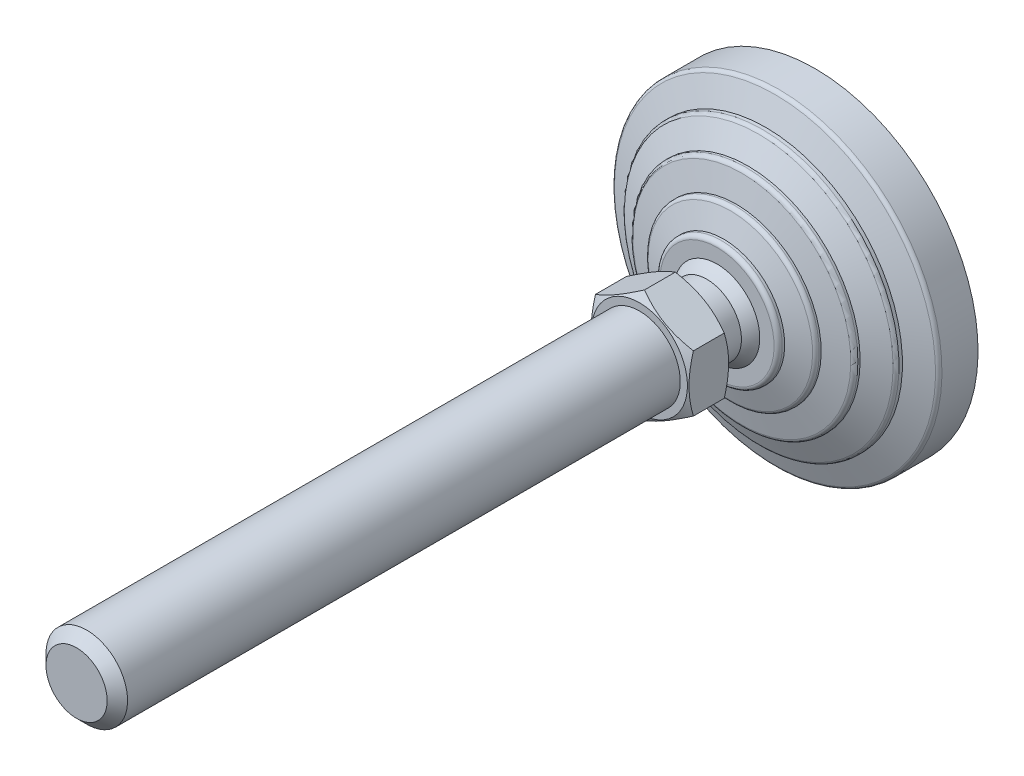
ISO-10303-21;
HEADER;
FILE_DESCRIPTION(('STEP AP214'),'2;1');
FILE_NAME('part.step','',(''),(''),'','','');
FILE_SCHEMA(('AUTOMOTIVE_DESIGN { 1 0 10303 214 1 1 1 1 }'));
ENDSEC;
DATA;
#1=APPLICATION_CONTEXT('core data for automotive mechanical design processes');
#2=APPLICATION_PROTOCOL_DEFINITION('international standard','automotive_design',2000,#1);
#3=PRODUCT_CONTEXT('',#1,'mechanical');
#4=PRODUCT('Part','Part','',(#3));
#5=PRODUCT_RELATED_PRODUCT_CATEGORY('part','',(#4));
#6=PRODUCT_DEFINITION_FORMATION('','',#4);
#7=PRODUCT_DEFINITION_CONTEXT('part definition',#1,'design');
#8=PRODUCT_DEFINITION('design','',#6,#7);
#9=PRODUCT_DEFINITION_SHAPE('','',#8);
#10=(LENGTH_UNIT() NAMED_UNIT(*) SI_UNIT(.MILLI.,.METRE.));
#11=(NAMED_UNIT(*) PLANE_ANGLE_UNIT() SI_UNIT($,.RADIAN.));
#12=(NAMED_UNIT(*) SI_UNIT($,.STERADIAN.) SOLID_ANGLE_UNIT());
#13=UNCERTAINTY_MEASURE_WITH_UNIT(LENGTH_MEASURE(1.E-05),#10,'distance_accuracy_value','');
#14=(GEOMETRIC_REPRESENTATION_CONTEXT(3) GLOBAL_UNCERTAINTY_ASSIGNED_CONTEXT((#13)) GLOBAL_UNIT_ASSIGNED_CONTEXT((#10,
#11,#12)) REPRESENTATION_CONTEXT('',''));
#15=CARTESIAN_POINT('',(0.,0.,0.));
#16=DIRECTION('',(0.,0.,1.));
#17=DIRECTION('',(1.,0.,0.));
#18=AXIS2_PLACEMENT_3D('',#15,#16,#17);
#19=CARTESIAN_POINT('',(-8.49999999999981,0.,35.9999999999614));
#20=DIRECTION('',(0.,0.,1.));
#21=DIRECTION('',(0.,-1.,0.));
#22=AXIS2_PLACEMENT_3D('',#19,#20,#21);
#23=PLANE('',#22);
#24=CARTESIAN_POINT('',(0.,0.,35.9999999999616));
#25=DIRECTION('',(0.,0.,-1.));
#26=DIRECTION('',(-1.,0.,0.));
#27=AXIS2_PLACEMENT_3D('',#24,#25,#26);
#28=CIRCLE('',#27,11.75);
#29=CARTESIAN_POINT('',(-11.75,0.,35.9999999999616));
#30=VERTEX_POINT('',#29);
#31=EDGE_CURVE('E596',#30,#30,#28,.T.);
#32=ORIENTED_EDGE('',*,*,#31,.T.);
#33=EDGE_LOOP('',(#32));
#34=FACE_BOUND('',#33,.T.);
#35=CARTESIAN_POINT('',(0.,0.,35.9999999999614));
#36=DIRECTION('',(0.,0.,-1.));
#37=DIRECTION('',(0.,1.,0.));
#38=AXIS2_PLACEMENT_3D('',#35,#36,#37);
#39=CIRCLE('',#38,8.49999999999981);
#40=CARTESIAN_POINT('',(0.,8.49999999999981,35.9999999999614));
#41=VERTEX_POINT('',#40);
#42=EDGE_CURVE('E156',#41,#41,#39,.T.);
#43=ORIENTED_EDGE('',*,*,#42,.F.);
#44=EDGE_LOOP('',(#43));
#45=FACE_BOUND('',#44,.T.);
#46=ADVANCED_FACE('F14',(#34,#45),#23,.F.);
#47=CARTESIAN_POINT('',(0.,0.,0.));
#48=DIRECTION('',(0.,0.,-1.));
#49=DIRECTION('',(0.,1.,0.));
#50=AXIS2_PLACEMENT_3D('',#47,#48,#49);
#51=CYLINDRICAL_SURFACE('',#50,8.49999999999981);
#52=CARTESIAN_POINT('',(0.,0.,29.4999999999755));
#53=DIRECTION('',(0.,0.,-1.));
#54=DIRECTION('',(0.,1.,0.));
#55=AXIS2_PLACEMENT_3D('',#52,#53,#54);
#56=CIRCLE('',#55,8.49999999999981);
#57=CARTESIAN_POINT('',(0.,8.49999999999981,29.4999999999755));
#58=VERTEX_POINT('',#57);
#59=EDGE_CURVE('E153',#58,#58,#56,.T.);
#60=ORIENTED_EDGE('',*,*,#59,.F.);
#61=EDGE_LOOP('',(#60));
#62=FACE_BOUND('',#61,.T.);
#63=ORIENTED_EDGE('',*,*,#42,.T.);
#64=EDGE_LOOP('',(#63));
#65=FACE_BOUND('',#64,.T.);
#66=ADVANCED_FACE('F180',(#62,#65),#51,.T.);
#67=CARTESIAN_POINT('',(-8.49107182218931,0.,29.4999999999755));
#68=DIRECTION('',(0.,0.,1.));
#69=DIRECTION('',(0.,-1.,0.));
#70=AXIS2_PLACEMENT_3D('',#67,#68,#69);
#71=PLANE('',#70);
#72=CARTESIAN_POINT('',(0.,0.,29.4999999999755));
#73=DIRECTION('',(0.,0.,-1.));
#74=DIRECTION('',(0.,1.,0.));
#75=AXIS2_PLACEMENT_3D('',#72,#73,#74);
#76=CIRCLE('',#75,8.49107182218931);
#77=CARTESIAN_POINT('',(-8.49107182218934,0.,29.4999999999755));
#78=VERTEX_POINT('',#77);
#79=EDGE_CURVE('E150',#78,#78,#76,.T.);
#80=ORIENTED_EDGE('',*,*,#79,.F.);
#81=EDGE_LOOP('',(#80));
#82=FACE_BOUND('',#81,.T.);
#83=ORIENTED_EDGE('',*,*,#59,.T.);
#84=EDGE_LOOP('',(#83));
#85=FACE_BOUND('',#84,.T.);
#86=ADVANCED_FACE('F187',(#82,#85),#71,.F.);
#87=CARTESIAN_POINT('',(-2.77555756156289E-12,0.,20.6702661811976));
#88=DIRECTION('',(0.,0.,-1.));
#89=DIRECTION('',(-1.,0.,0.));
#90=AXIS2_PLACEMENT_3D('',#87,#88,#89);
#91=SPHERICAL_SURFACE('',#90,12.25);
#92=CARTESIAN_POINT('',(0.,0.,27.));
#93=DIRECTION('',(0.,0.,-1.));
#94=DIRECTION('',(0.,1.,0.));
#95=AXIS2_PLACEMENT_3D('',#92,#93,#94);
#96=CIRCLE('',#95,10.4879440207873);
#97=CARTESIAN_POINT('',(-10.4879440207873,0.,27.));
#98=VERTEX_POINT('',#97);
#99=EDGE_CURVE('E147',#98,#98,#96,.T.);
#100=CARTESIAN_POINT('',(-10.4879440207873,0.,27.));
#101=CARTESIAN_POINT('',(-10.4706730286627,0.,27.0286168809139));
#102=CARTESIAN_POINT('',(-10.4532849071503,0.,27.0571630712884));
#103=CARTESIAN_POINT('',(-10.4182755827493,0.,27.1141121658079));
#104=CARTESIAN_POINT('',(-10.4006543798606,0.,27.1425150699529));
#105=CARTESIAN_POINT('',(-10.3651800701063,0.,27.1991756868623));
#106=CARTESIAN_POINT('',(-10.3473269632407,0.,27.2274333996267));
#107=CARTESIAN_POINT('',(-10.3113900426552,0.,27.283801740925));
#108=CARTESIAN_POINT('',(-10.2933062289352,0.,27.3119123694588));
#109=CARTESIAN_POINT('',(-10.2569091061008,0.,27.367984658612));
#110=CARTESIAN_POINT('',(-10.2385957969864,0.,27.3959463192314));
#111=CARTESIAN_POINT('',(-10.2017409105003,0.,27.4517187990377));
#112=CARTESIAN_POINT('',(-10.1831993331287,0.,27.4795296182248));
#113=CARTESIAN_POINT('',(-10.1458891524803,0.,27.5349985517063));
#114=CARTESIAN_POINT('',(-10.1271205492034,0.,27.5626566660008));
#115=CARTESIAN_POINT('',(-10.0893575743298,0.,27.6178183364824));
#116=CARTESIAN_POINT('',(-10.070363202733,0.,27.6453218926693));
#117=CARTESIAN_POINT('',(-10.0321499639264,0.,27.7001726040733));
#118=CARTESIAN_POINT('',(-10.0129310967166,0.,27.7275197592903));
#119=CARTESIAN_POINT('',(-9.97427015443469,0.,27.7820558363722));
#120=CARTESIAN_POINT('',(-9.95482807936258,0.,27.8092447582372));
#121=CARTESIAN_POINT('',(-9.91572202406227,0.,27.8634625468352));
#122=CARTESIAN_POINT('',(-9.89605804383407,0.,27.8904914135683));
#123=CARTESIAN_POINT('',(-9.8565094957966,0.,27.9443872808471));
#124=CARTESIAN_POINT('',(-9.83662492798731,0.,27.9712542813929));
#125=CARTESIAN_POINT('',(-9.79663653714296,0.,28.0248246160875));
#126=CARTESIAN_POINT('',(-9.77653271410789,0.,28.0515279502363));
#127=CARTESIAN_POINT('',(-9.73610715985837,0.,28.1047691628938));
#128=CARTESIAN_POINT('',(-9.71578542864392,0.,28.1313070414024));
#129=CARTESIAN_POINT('',(-9.67492541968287,0.,28.1842155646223));
#130=CARTESIAN_POINT('',(-9.65438714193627,0.,28.2105862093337));
#131=CARTESIAN_POINT('',(-9.61309541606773,0.,28.2631584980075));
#132=CARTESIAN_POINT('',(-9.5923419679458,0.,28.2893601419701));
#133=CARTESIAN_POINT('',(-9.55062129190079,0.,28.3415926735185));
#134=CARTESIAN_POINT('',(-9.52965406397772,0.,28.3676235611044));
#135=CARTESIAN_POINT('',(-9.48750723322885,0.,28.4195128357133));
#136=CARTESIAN_POINT('',(-9.46632763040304,0.,28.4453712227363));
#137=CARTESIAN_POINT('',(-9.42375746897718,0.,28.4969137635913));
#138=CARTESIAN_POINT('',(-9.40236691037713,0.,28.5225979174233));
#139=CARTESIAN_POINT('',(-9.35937627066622,0.,28.5737902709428));
#140=CARTESIAN_POINT('',(-9.33777618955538,0.,28.5992984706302));
#141=CARTESIAN_POINT('',(-9.2943679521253,0.,28.6501372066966));
#142=CARTESIAN_POINT('',(-9.27255979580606,0.,28.6754677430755));
#143=CARTESIAN_POINT('',(-9.22873686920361,0.,28.7259494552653));
#144=CARTESIAN_POINT('',(-9.20672209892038,0.,28.7511006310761));
#145=CARTESIAN_POINT('',(-9.16248741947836,0.,28.8012219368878));
#146=CARTESIAN_POINT('',(-9.14026751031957,0.,28.8261920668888));
#147=CARTESIAN_POINT('',(-9.09562404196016,0.,28.87594960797));
#148=CARTESIAN_POINT('',(-9.07320048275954,0.,28.9007370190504));
#149=CARTESIAN_POINT('',(-9.02815121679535,0.,28.9501274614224));
#150=CARTESIAN_POINT('',(-9.00552551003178,0.,28.974730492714));
#151=CARTESIAN_POINT('',(-8.96007346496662,0.,29.023750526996));
#152=CARTESIAN_POINT('',(-8.93724712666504,0.,29.0481675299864));
#153=CARTESIAN_POINT('',(-8.89139534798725,0.,29.0968138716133));
#154=CARTESIAN_POINT('',(-8.86836990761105,0.,29.1210432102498));
#155=CARTESIAN_POINT('',(-8.82212146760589,0.,29.1693125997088));
#156=CARTESIAN_POINT('',(-8.79889846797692,0.,29.1933526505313));
#157=CARTESIAN_POINT('',(-8.75225646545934,0.,29.2412418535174));
#158=CARTESIAN_POINT('',(-8.72883746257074,0.,29.2650910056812));
#159=CARTESIAN_POINT('',(-8.68180502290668,0.,29.3125968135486));
#160=CARTESIAN_POINT('',(-8.65819158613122,0.,29.3362534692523));
#161=CARTESIAN_POINT('',(-8.61077186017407,0.,29.3833726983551));
#162=CARTESIAN_POINT('',(-8.58696557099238,0.,29.4068352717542));
#163=CARTESIAN_POINT('',(-8.53916173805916,0.,29.4535647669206));
#164=CARTESIAN_POINT('',(-8.51516419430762,0.,29.4768316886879));
#165=CARTESIAN_POINT('',(-8.49107182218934,0.,29.4999999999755));
#166=B_SPLINE_CURVE_WITH_KNOTS('',3,(#100,#101,#102,#103,#104,#105,#106,#107,#108,#109,#110,
#111,#112,#113,#114,#115,#116,#117,#118,#119,#120,#121,#122,#123,#124,#125,#126,#127,#128,#129,
#130,#131,#132,#133,#134,#135,#136,#137,#138,#139,#140,#141,#142,#143,#144,#145,#146,#147,#148,
#149,#150,#151,#152,#153,#154,#155,#156,#157,#158,#159,#160,#161,#162,#163,#164,#165),
.UNSPECIFIED.,.F.,.F.,(4,2,2,2,2,2,2,2,2,2,2,2,2,2,2,2,2,2,2,2,2,2,2,2,2,2,2,2,2,2,2,2,4),(0.,
0.100273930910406,0.200547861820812,0.300821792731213,0.401095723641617,0.501369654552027,
0.60164358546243,0.701917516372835,0.802191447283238,0.902465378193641,1.00273930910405,
1.10301324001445,1.20328717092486,1.30356110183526,1.40383503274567,1.50410896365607,
1.60438289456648,1.70465682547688,1.80493075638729,1.90520468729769,2.00547861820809,
2.1057525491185,2.20602648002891,2.30630041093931,2.40657434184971,2.50684827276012,
2.60712220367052,2.70739613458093,2.80767006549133,2.90794399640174,3.00821792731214,
3.10849185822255,3.20876578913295),.UNSPECIFIED.);
#167=EDGE_CURVE('BSEAM459',#98,#78,#166,.T.);
#168=ORIENTED_EDGE('',*,*,#99,.F.);
#169=ORIENTED_EDGE('',*,*,#79,.T.);
#170=ORIENTED_EDGE('',*,*,#167,.T.);
#171=ORIENTED_EDGE('',*,*,#167,.F.);
#172=EDGE_LOOP('',(#168,#170,#169,#171));
#173=FACE_BOUND('',#172,.T.);
#174=ADVANCED_FACE('F459',(#173),#91,.T.);
#175=CARTESIAN_POINT('',(-10.4879440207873,0.,27.));
#176=DIRECTION('',(0.,0.,-1.));
#177=DIRECTION('',(0.,1.,0.));
#178=AXIS2_PLACEMENT_3D('',#175,#176,#177);
#179=PLANE('',#178);
#180=CARTESIAN_POINT('',(0.,0.,27.));
#181=DIRECTION('',(0.,0.,-1.));
#182=DIRECTION('',(0.,1.,0.));
#183=AXIS2_PLACEMENT_3D('',#180,#181,#182);
#184=CIRCLE('',#183,13.9999999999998);
#185=CARTESIAN_POINT('',(0.,13.9999999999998,27.));
#186=VERTEX_POINT('',#185);
#187=EDGE_CURVE('E144',#186,#186,#184,.T.);
#188=ORIENTED_EDGE('',*,*,#187,.F.);
#189=EDGE_LOOP('',(#188));
#190=FACE_BOUND('',#189,.T.);
#191=ORIENTED_EDGE('',*,*,#99,.T.);
#192=EDGE_LOOP('',(#191));
#193=FACE_BOUND('',#192,.T.);
#194=ADVANCED_FACE('F449',(#190,#193),#179,.F.);
#195=CARTESIAN_POINT('',(0.,0.,26.));
#196=DIRECTION('',(0.,0.,-1.));
#197=DIRECTION('',(0.,1.,0.));
#198=AXIS2_PLACEMENT_3D('',#195,#196,#197);
#199=TOROIDAL_SURFACE('',#198,13.9999999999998,1.);
#200=CARTESIAN_POINT('',(0.,0.,26.));
#201=DIRECTION('',(0.,0.,-1.));
#202=DIRECTION('',(0.,1.,0.));
#203=AXIS2_PLACEMENT_3D('',#200,#201,#202);
#204=CIRCLE('',#203,14.9999999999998);
#205=CARTESIAN_POINT('',(0.,14.9999999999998,26.));
#206=VERTEX_POINT('',#205);
#207=EDGE_CURVE('E141',#206,#206,#204,.T.);
#208=ORIENTED_EDGE('',*,*,#207,.F.);
#209=EDGE_LOOP('',(#208));
#210=FACE_BOUND('',#209,.T.);
#211=ORIENTED_EDGE('',*,*,#187,.T.);
#212=EDGE_LOOP('',(#211));
#213=FACE_BOUND('',#212,.T.);
#214=ADVANCED_FACE('F439',(#210,#213),#199,.T.);
#215=CARTESIAN_POINT('',(0.,0.,0.));
#216=DIRECTION('',(0.,0.,-1.));
#217=DIRECTION('',(0.,1.,0.));
#218=AXIS2_PLACEMENT_3D('',#215,#216,#217);
#219=CYLINDRICAL_SURFACE('',#218,14.9999999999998);
#220=CARTESIAN_POINT('',(0.,0.,25.4025287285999));
#221=DIRECTION('',(0.,0.,-1.));
#222=DIRECTION('',(0.,1.,0.));
#223=AXIS2_PLACEMENT_3D('',#220,#221,#222);
#224=CIRCLE('',#223,14.9999999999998);
#225=CARTESIAN_POINT('',(0.,14.9999999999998,25.4025287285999));
#226=VERTEX_POINT('',#225);
#227=EDGE_CURVE('E138',#226,#226,#224,.T.);
#228=ORIENTED_EDGE('',*,*,#227,.F.);
#229=EDGE_LOOP('',(#228));
#230=FACE_BOUND('',#229,.T.);
#231=ORIENTED_EDGE('',*,*,#207,.T.);
#232=EDGE_LOOP('',(#231));
#233=FACE_BOUND('',#232,.T.);
#234=ADVANCED_FACE('F429',(#230,#233),#219,.T.);
#235=CARTESIAN_POINT('',(0.,0.,25.4025287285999));
#236=DIRECTION('',(0.,0.,-1.));
#237=DIRECTION('',(0.,1.,0.));
#238=AXIS2_PLACEMENT_3D('',#235,#236,#237);
#239=CONICAL_SURFACE('',#238,14.9999999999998,1.25589726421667);
#240=CARTESIAN_POINT('',(0.,0.,23.7216684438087));
#241=DIRECTION('',(0.,0.,-1.));
#242=DIRECTION('',(0.,1.,0.));
#243=AXIS2_PLACEMENT_3D('',#240,#241,#242);
#244=CIRCLE('',#243,20.1601635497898);
#245=CARTESIAN_POINT('',(0.,20.1601635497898,23.7216684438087));
#246=VERTEX_POINT('',#245);
#247=EDGE_CURVE('E135',#246,#246,#244,.T.);
#248=ORIENTED_EDGE('',*,*,#247,.F.);
#249=EDGE_LOOP('',(#248));
#250=FACE_BOUND('',#249,.T.);
#251=ORIENTED_EDGE('',*,*,#227,.T.);
#252=EDGE_LOOP('',(#251));
#253=FACE_BOUND('',#252,.T.);
#254=ADVANCED_FACE('F419',(#250,#253),#239,.T.);
#255=CARTESIAN_POINT('',(0.,0.,22.7708407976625));
#256=DIRECTION('',(0.,0.,-1.));
#257=DIRECTION('',(0.,1.,0.));
#258=AXIS2_PLACEMENT_3D('',#255,#256,#257);
#259=TOROIDAL_SURFACE('',#258,19.8504430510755,1.);
#260=CARTESIAN_POINT('',(0.,0.,22.7708407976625));
#261=DIRECTION('',(0.,0.,-1.));
#262=DIRECTION('',(0.,1.,0.));
#263=AXIS2_PLACEMENT_3D('',#260,#261,#262);
#264=CIRCLE('',#263,20.8504430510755);
#265=CARTESIAN_POINT('',(0.,20.8504430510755,22.7708407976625));
#266=VERTEX_POINT('',#265);
#267=EDGE_CURVE('E132',#266,#266,#264,.T.);
#268=ORIENTED_EDGE('',*,*,#267,.F.);
#269=EDGE_LOOP('',(#268));
#270=FACE_BOUND('',#269,.T.);
#271=ORIENTED_EDGE('',*,*,#247,.T.);
#272=EDGE_LOOP('',(#271));
#273=FACE_BOUND('',#272,.T.);
#274=ADVANCED_FACE('F409',(#270,#273),#259,.T.);
#275=CARTESIAN_POINT('',(0.,0.,0.));
#276=DIRECTION('',(0.,0.,-1.));
#277=DIRECTION('',(0.,1.,0.));
#278=AXIS2_PLACEMENT_3D('',#275,#276,#277);
#279=CYLINDRICAL_SURFACE('',#278,20.8504430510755);
#280=CARTESIAN_POINT('',(0.,0.,22.2987385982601));
#281=DIRECTION('',(0.,0.,-1.));
#282=DIRECTION('',(0.,1.,0.));
#283=AXIS2_PLACEMENT_3D('',#280,#281,#282);
#284=CIRCLE('',#283,20.8504430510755);
#285=CARTESIAN_POINT('',(0.,20.8504430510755,22.2987385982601));
#286=VERTEX_POINT('',#285);
#287=EDGE_CURVE('E129',#286,#286,#284,.T.);
#288=ORIENTED_EDGE('',*,*,#287,.F.);
#289=EDGE_LOOP('',(#288));
#290=FACE_BOUND('',#289,.T.);
#291=ORIENTED_EDGE('',*,*,#267,.T.);
#292=EDGE_LOOP('',(#291));
#293=FACE_BOUND('',#292,.T.);
#294=ADVANCED_FACE('F399',(#290,#293),#279,.T.);
#295=CARTESIAN_POINT('',(0.,0.,22.2987385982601));
#296=DIRECTION('',(0.,0.,-1.));
#297=DIRECTION('',(0.,1.,0.));
#298=AXIS2_PLACEMENT_3D('',#295,#296,#297);
#299=CONICAL_SURFACE('',#298,20.8504430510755,1.34067144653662);
#300=CARTESIAN_POINT('',(0.,0.,20.9217501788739));
#301=DIRECTION('',(0.,0.,-1.));
#302=DIRECTION('',(0.,1.,0.));
#303=AXIS2_PLACEMENT_3D('',#300,#301,#302);
#304=CIRCLE('',#303,26.7280991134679);
#305=CARTESIAN_POINT('',(0.,26.7280991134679,20.9217501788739));
#306=VERTEX_POINT('',#305);
#307=EDGE_CURVE('E126',#306,#306,#304,.T.);
#308=ORIENTED_EDGE('',*,*,#307,.F.);
#309=EDGE_LOOP('',(#308));
#310=FACE_BOUND('',#309,.T.);
#311=ORIENTED_EDGE('',*,*,#287,.T.);
#312=EDGE_LOOP('',(#311));
#313=FACE_BOUND('',#312,.T.);
#314=ADVANCED_FACE('F389',(#310,#313),#299,.T.);
#315=CARTESIAN_POINT('',(0.,0.,19.9481122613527));
#316=DIRECTION('',(0.,0.,-1.));
#317=DIRECTION('',(0.,1.,0.));
#318=AXIS2_PLACEMENT_3D('',#315,#316,#317);
#319=TOROIDAL_SURFACE('',#318,26.5,1.);
#320=CARTESIAN_POINT('',(0.,0.,19.9481122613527));
#321=DIRECTION('',(0.,0.,-1.));
#322=DIRECTION('',(0.,1.,0.));
#323=AXIS2_PLACEMENT_3D('',#320,#321,#322);
#324=CIRCLE('',#323,27.5);
#325=CARTESIAN_POINT('',(0.,27.5,19.9481122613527));
#326=VERTEX_POINT('',#325);
#327=EDGE_CURVE('E123',#326,#326,#324,.T.);
#328=ORIENTED_EDGE('',*,*,#327,.F.);
#329=EDGE_LOOP('',(#328));
#330=FACE_BOUND('',#329,.T.);
#331=ORIENTED_EDGE('',*,*,#307,.T.);
#332=EDGE_LOOP('',(#331));
#333=FACE_BOUND('',#332,.T.);
#334=ADVANCED_FACE('F379',(#330,#333),#319,.T.);
#335=CARTESIAN_POINT('',(0.,0.,0.));
#336=DIRECTION('',(0.,0.,-1.));
#337=DIRECTION('',(0.,1.,0.));
#338=AXIS2_PLACEMENT_3D('',#335,#336,#337);
#339=CYLINDRICAL_SURFACE('',#338,27.5);
#340=CARTESIAN_POINT('',(0.,0.,19.4025287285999));
#341=DIRECTION('',(0.,0.,-1.));
#342=DIRECTION('',(0.,1.,0.));
#343=AXIS2_PLACEMENT_3D('',#340,#341,#342);
#344=CIRCLE('',#343,27.5);
#345=CARTESIAN_POINT('',(0.,27.5,19.4025287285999));
#346=VERTEX_POINT('',#345);
#347=EDGE_CURVE('E120',#346,#346,#344,.T.);
#348=ORIENTED_EDGE('',*,*,#347,.F.);
#349=EDGE_LOOP('',(#348));
#350=FACE_BOUND('',#349,.T.);
#351=ORIENTED_EDGE('',*,*,#327,.T.);
#352=EDGE_LOOP('',(#351));
#353=FACE_BOUND('',#352,.T.);
#354=ADVANCED_FACE('F369',(#350,#353),#339,.T.);
#355=CARTESIAN_POINT('',(0.,0.,19.4025287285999));
#356=DIRECTION('',(0.,0.,-1.));
#357=DIRECTION('',(0.,1.,0.));
#358=AXIS2_PLACEMENT_3D('',#355,#356,#357);
#359=CONICAL_SURFACE('',#358,27.5,1.12022914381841);
#360=CARTESIAN_POINT('',(0.,0.,16.7730910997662));
#361=DIRECTION('',(0.,0.,-1.));
#362=DIRECTION('',(0.,1.,0.));
#363=AXIS2_PLACEMENT_3D('',#360,#361,#362);
#364=CIRCLE('',#363,32.9354761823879);
#365=CARTESIAN_POINT('',(0.,32.9354761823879,16.7730910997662));
#366=VERTEX_POINT('',#365);
#367=EDGE_CURVE('E117',#366,#366,#364,.T.);
#368=ORIENTED_EDGE('',*,*,#367,.F.);
#369=EDGE_LOOP('',(#368));
#370=FACE_BOUND('',#369,.T.);
#371=ORIENTED_EDGE('',*,*,#347,.T.);
#372=EDGE_LOOP('',(#371));
#373=FACE_BOUND('',#372,.T.);
#374=ADVANCED_FACE('F359',(#370,#373),#359,.T.);
#375=CARTESIAN_POINT('',(0.,0.,15.8728908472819));
#376=DIRECTION('',(0.,0.,-1.));
#377=DIRECTION('',(0.,1.,0.));
#378=AXIS2_PLACEMENT_3D('',#375,#376,#377);
#379=TOROIDAL_SURFACE('',#378,32.5,1.);
#380=CARTESIAN_POINT('',(0.,0.,15.8728908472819));
#381=DIRECTION('',(0.,0.,-1.));
#382=DIRECTION('',(0.,1.,0.));
#383=AXIS2_PLACEMENT_3D('',#380,#381,#382);
#384=CIRCLE('',#383,33.5);
#385=CARTESIAN_POINT('',(0.,33.5,15.8728908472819));
#386=VERTEX_POINT('',#385);
#387=EDGE_CURVE('E114',#386,#386,#384,.T.);
#388=ORIENTED_EDGE('',*,*,#387,.F.);
#389=EDGE_LOOP('',(#388));
#390=FACE_BOUND('',#389,.T.);
#391=ORIENTED_EDGE('',*,*,#367,.T.);
#392=EDGE_LOOP('',(#391));
#393=FACE_BOUND('',#392,.T.);
#394=ADVANCED_FACE('F349',(#390,#393),#379,.T.);
#395=CARTESIAN_POINT('',(0.,0.,0.));
#396=DIRECTION('',(0.,0.,-1.));
#397=DIRECTION('',(0.,1.,0.));
#398=AXIS2_PLACEMENT_3D('',#395,#396,#397);
#399=CYLINDRICAL_SURFACE('',#398,33.5);
#400=CARTESIAN_POINT('',(0.,0.,15.0315037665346));
#401=DIRECTION('',(0.,0.,-1.));
#402=DIRECTION('',(0.,1.,0.));
#403=AXIS2_PLACEMENT_3D('',#400,#401,#402);
#404=CIRCLE('',#403,33.5);
#405=CARTESIAN_POINT('',(0.,33.5,15.0315037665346));
#406=VERTEX_POINT('',#405);
#407=EDGE_CURVE('E111',#406,#406,#404,.T.);
#408=ORIENTED_EDGE('',*,*,#407,.F.);
#409=EDGE_LOOP('',(#408));
#410=FACE_BOUND('',#409,.T.);
#411=ORIENTED_EDGE('',*,*,#387,.T.);
#412=EDGE_LOOP('',(#411));
#413=FACE_BOUND('',#412,.T.);
#414=ADVANCED_FACE('F339',(#410,#413),#399,.T.);
#415=CARTESIAN_POINT('',(0.,0.,15.0315037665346));
#416=DIRECTION('',(0.,0.,-1.));
#417=DIRECTION('',(0.,1.,0.));
#418=AXIS2_PLACEMENT_3D('',#415,#416,#417);
#419=CONICAL_SURFACE('',#418,33.5,1.20362249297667);
#420=CARTESIAN_POINT('',(0.,0.,12.7780502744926));
#421=DIRECTION('',(0.,0.,-1.));
#422=DIRECTION('',(0.,1.,0.));
#423=AXIS2_PLACEMENT_3D('',#420,#421,#422);
#424=CIRCLE('',#423,39.3589790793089);
#425=CARTESIAN_POINT('',(0.,39.3589790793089,12.7780502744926));
#426=VERTEX_POINT('',#425);
#427=EDGE_CURVE('E108',#426,#426,#424,.T.);
#428=ORIENTED_EDGE('',*,*,#427,.F.);
#429=EDGE_LOOP('',(#428));
#430=FACE_BOUND('',#429,.T.);
#431=ORIENTED_EDGE('',*,*,#407,.T.);
#432=EDGE_LOOP('',(#431));
#433=FACE_BOUND('',#432,.T.);
#434=ADVANCED_FACE('F329',(#430,#433),#419,.T.);
#435=CARTESIAN_POINT('',(0.,0.,11.8447046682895));
#436=DIRECTION('',(0.,0.,-1.));
#437=DIRECTION('',(0.,1.,0.));
#438=AXIS2_PLACEMENT_3D('',#435,#436,#437);
#439=TOROIDAL_SURFACE('',#438,39.,1.);
#440=CARTESIAN_POINT('',(0.,0.,11.8447046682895));
#441=DIRECTION('',(0.,0.,-1.));
#442=DIRECTION('',(0.,1.,0.));
#443=AXIS2_PLACEMENT_3D('',#440,#441,#442);
#444=CIRCLE('',#443,40.);
#445=CARTESIAN_POINT('',(0.,40.,11.8447046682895));
#446=VERTEX_POINT('',#445);
#447=EDGE_CURVE('E105',#446,#446,#444,.T.);
#448=ORIENTED_EDGE('',*,*,#447,.F.);
#449=EDGE_LOOP('',(#448));
#450=FACE_BOUND('',#449,.T.);
#451=ORIENTED_EDGE('',*,*,#427,.T.);
#452=EDGE_LOOP('',(#451));
#453=FACE_BOUND('',#452,.T.);
#454=ADVANCED_FACE('F319',(#450,#453),#439,.T.);
#455=CARTESIAN_POINT('',(0.,0.,0.));
#456=DIRECTION('',(0.,0.,-1.));
#457=DIRECTION('',(0.,1.,0.));
#458=AXIS2_PLACEMENT_3D('',#455,#456,#457);
#459=CYLINDRICAL_SURFACE('',#458,40.);
#460=CARTESIAN_POINT('',(0.,0.,3.));
#461=DIRECTION('',(0.,0.,-1.));
#462=DIRECTION('',(0.,1.,0.));
#463=AXIS2_PLACEMENT_3D('',#460,#461,#462);
#464=CIRCLE('',#463,40.);
#465=CARTESIAN_POINT('',(0.,40.,3.));
#466=VERTEX_POINT('',#465);
#467=EDGE_CURVE('E102',#466,#466,#464,.T.);
#468=ORIENTED_EDGE('',*,*,#467,.F.);
#469=EDGE_LOOP('',(#468));
#470=FACE_BOUND('',#469,.T.);
#471=ORIENTED_EDGE('',*,*,#447,.T.);
#472=EDGE_LOOP('',(#471));
#473=FACE_BOUND('',#472,.T.);
#474=ADVANCED_FACE('F309',(#470,#473),#459,.T.);
#475=CARTESIAN_POINT('',(-33.5,0.,3.));
#476=DIRECTION('',(0.,0.,1.));
#477=DIRECTION('',(0.,-1.,0.));
#478=AXIS2_PLACEMENT_3D('',#475,#476,#477);
#479=PLANE('',#478);
#480=CARTESIAN_POINT('',(0.,0.,3.));
#481=DIRECTION('',(0.,0.,-1.));
#482=DIRECTION('',(0.,1.,0.));
#483=AXIS2_PLACEMENT_3D('',#480,#481,#482);
#484=CIRCLE('',#483,33.5);
#485=CARTESIAN_POINT('',(0.,33.5,3.));
#486=VERTEX_POINT('',#485);
#487=EDGE_CURVE('E99',#486,#486,#484,.T.);
#488=ORIENTED_EDGE('',*,*,#487,.F.);
#489=EDGE_LOOP('',(#488));
#490=FACE_BOUND('',#489,.T.);
#491=ORIENTED_EDGE('',*,*,#467,.T.);
#492=EDGE_LOOP('',(#491));
#493=FACE_BOUND('',#492,.T.);
#494=ADVANCED_FACE('F299',(#490,#493),#479,.F.);
#495=CARTESIAN_POINT('',(0.,0.,0.));
#496=DIRECTION('',(0.,0.,-1.));
#497=DIRECTION('',(0.,1.,0.));
#498=AXIS2_PLACEMENT_3D('',#495,#496,#497);
#499=CYLINDRICAL_SURFACE('',#498,33.5);
#500=CARTESIAN_POINT('',(0.,0.,0.));
#501=DIRECTION('',(0.,0.,-1.));
#502=DIRECTION('',(0.,1.,0.));
#503=AXIS2_PLACEMENT_3D('',#500,#501,#502);
#504=CIRCLE('',#503,33.5);
#505=CARTESIAN_POINT('',(0.,33.5,0.));
#506=VERTEX_POINT('',#505);
#507=EDGE_CURVE('E96',#506,#506,#504,.T.);
#508=ORIENTED_EDGE('',*,*,#507,.F.);
#509=EDGE_LOOP('',(#508));
#510=FACE_BOUND('',#509,.T.);
#511=ORIENTED_EDGE('',*,*,#487,.T.);
#512=EDGE_LOOP('',(#511));
#513=FACE_BOUND('',#512,.T.);
#514=ADVANCED_FACE('F288',(#510,#513),#499,.T.);
#515=CARTESIAN_POINT('',(0.,0.,0.));
#516=DIRECTION('',(0.,0.,1.));
#517=DIRECTION('',(0.,-1.,0.));
#518=AXIS2_PLACEMENT_3D('',#515,#516,#517);
#519=PLANE('',#518);
#520=ORIENTED_EDGE('',*,*,#507,.T.);
#521=EDGE_LOOP('',(#520));
#522=FACE_BOUND('',#521,.T.);
#523=ADVANCED_FACE('F178',(#522),#519,.F.);
#524=CARTESIAN_POINT('',(0.,0.,39.2222580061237));
#525=DIRECTION('',(0.,0.,1.));
#526=DIRECTION('',(1.,0.,0.));
#527=AXIS2_PLACEMENT_3D('',#524,#525,#526);
#528=CONICAL_SURFACE('',#527,17.3311145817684,1.0471975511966);
#529=CARTESIAN_POINT('',(0.430731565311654,-14.1050894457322,37.3635076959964));
#530=CARTESIAN_POINT('',(0.150692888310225,-13.9434090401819,37.2652936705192));
#531=CARTESIAN_POINT('',(-0.130438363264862,-13.7810978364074,37.1712924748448));
#532=CARTESIAN_POINT('',(-0.695145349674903,-13.4550641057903,36.9930040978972));
#533=CARTESIAN_POINT('',(-0.97872222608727,-13.2913409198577,36.9087217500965));
#534=CARTESIAN_POINT('',(-1.83468163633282,-12.797152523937,36.6720889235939));
#535=CARTESIAN_POINT('',(-2.41073133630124,-12.4645700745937,36.5365159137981));
#536=CARTESIAN_POINT('',(-3.27221449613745,-11.9671925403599,36.3767511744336));
#537=CARTESIAN_POINT('',(-3.55473791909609,-11.8040775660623,36.3311363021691));
#538=CARTESIAN_POINT('',(-4.1212715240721,-11.4769892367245,36.254214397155));
#539=CARTESIAN_POINT('',(-4.40528172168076,-11.3130158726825,36.2229075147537));
#540=CARTESIAN_POINT('',(-4.97379635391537,-10.9847837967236,36.1754984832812));
#541=CARTESIAN_POINT('',(-5.25829925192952,-10.8205259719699,36.1593718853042));
#542=CARTESIAN_POINT('',(-5.82765001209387,-10.4918111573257,36.142695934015));
#543=CARTESIAN_POINT('',(-6.11249787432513,-10.3273541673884,36.1421465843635));
#544=CARTESIAN_POINT('',(-6.70000793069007,-9.9881550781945,36.1571067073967));
#545=CARTESIAN_POINT('',(-7.00265074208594,-9.81342416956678,36.1736398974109));
#546=CARTESIAN_POINT('',(-7.60686816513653,-9.46457907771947,36.2238170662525));
#547=CARTESIAN_POINT('',(-7.90844274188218,-9.29046491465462,36.2574615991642));
#548=CARTESIAN_POINT('',(-8.51048424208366,-8.94287609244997,36.3409155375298));
#549=CARTESIAN_POINT('',(-8.81094791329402,-8.76940331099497,36.3907559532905));
#550=CARTESIAN_POINT('',(-9.4097348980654,-8.42369348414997,36.5052127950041));
#551=CARTESIAN_POINT('',(-9.70805823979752,-8.25145642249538,36.569829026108));
#552=CARTESIAN_POINT('',(-10.3118161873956,-7.90287660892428,36.714574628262));
#553=CARTESIAN_POINT('',(-10.6171729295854,-7.72657881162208,36.7951341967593));
#554=CARTESIAN_POINT('',(-11.225254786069,-7.37550258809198,36.9686326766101));
#555=CARTESIAN_POINT('',(-11.5279796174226,-7.20072432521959,37.0615729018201));
#556=CARTESIAN_POINT('',(-12.1295383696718,-6.85341421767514,37.2577656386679));
#557=CARTESIAN_POINT('',(-12.428383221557,-6.68087606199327,37.3609737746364));
#558=CARTESIAN_POINT('',(-13.0234684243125,-6.33730345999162,37.576544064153));
#559=CARTESIAN_POINT('',(-13.3197097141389,-6.16626847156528,37.6889027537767));
#560=CARTESIAN_POINT('',(-13.6147689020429,-5.995915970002,37.8051377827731));
#561=B_SPLINE_CURVE_WITH_KNOTS('',3,(#529,#530,#531,#532,#533,#534,#535,#536,#537,#538,#539,
#540,#541,#542,#543,#544,#545,#546,#547,#548,#549,#550,#551,#552,#553,#554,#555,#556,#557,#558,
#559,#560),.UNSPECIFIED.,.F.,.F.,(4,2,2,2,2,2,2,2,2,2,2,2,2,2,2,4),(0.,1.01375663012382,
2.028015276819,4.06219070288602,5.0501476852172,6.03811504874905,7.02448848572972,
8.01086215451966,9.05997861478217,10.1091290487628,11.1603002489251,12.2114575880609,
13.2962467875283,14.3811511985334,15.4615553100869,16.5415523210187),.UNSPECIFIED.);
#562=CARTESIAN_POINT('',(0.,-13.856406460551,37.2161343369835));
#563=VERTEX_POINT('',#562);
#564=CARTESIAN_POINT('',(-12.,-6.92820323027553,37.2161343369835));
#565=VERTEX_POINT('',#564);
#566=EDGE_CURVE('E73',#563,#565,#561,.T.);
#567=ORIENTED_EDGE('',*,*,#566,.T.);
#568=CARTESIAN_POINT('',(-12.,-18.6341085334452,42.0123577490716));
#569=CARTESIAN_POINT('',(-12.,-18.3719592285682,41.8851113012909));
#570=CARTESIAN_POINT('',(-12.,-18.1095029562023,41.7584975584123));
#571=CARTESIAN_POINT('',(-12.,-17.5839124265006,41.506678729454));
#572=CARTESIAN_POINT('',(-12.,-17.3207781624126,41.3814736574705));
#573=CARTESIAN_POINT('',(-12.,-16.5301925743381,41.0081534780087));
#574=CARTESIAN_POINT('',(-12.,-16.0016356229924,40.7623709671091));
#575=CARTESIAN_POINT('',(-12.,-14.938127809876,40.2771897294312));
#576=CARTESIAN_POINT('',(-12.,-14.4031578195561,40.0378328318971));
#577=CARTESIAN_POINT('',(-12.,-13.3289719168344,39.5688781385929));
#578=CARTESIAN_POINT('',(-12.,-12.7897562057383,39.3392798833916));
#579=CARTESIAN_POINT('',(-12.,-11.6887145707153,38.8852042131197));
#580=CARTESIAN_POINT('',(-12.,-11.1267208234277,38.6611316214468));
#581=CARTESIAN_POINT('',(-12.,-9.99616328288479,38.229885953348));
#582=CARTESIAN_POINT('',(-12.,-9.42759876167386,38.0227147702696));
#583=CARTESIAN_POINT('',(-12.,-8.2840700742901,37.6306960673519));
#584=CARTESIAN_POINT('',(-12.,-7.70912145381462,37.4458035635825));
#585=CARTESIAN_POINT('',(-12.,-6.55092230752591,37.1042487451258));
#586=CARTESIAN_POINT('',(-12.,-5.96767445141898,36.9475775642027));
#587=CARTESIAN_POINT('',(-12.,-5.08809086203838,36.7398233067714));
#588=CARTESIAN_POINT('',(-12.,-4.79492133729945,36.6752540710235));
#589=CARTESIAN_POINT('',(-12.,-4.20657457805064,36.5559664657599));
#590=CARTESIAN_POINT('',(-12.,-3.91139738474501,36.5012478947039));
#591=CARTESIAN_POINT('',(-12.,-3.31923691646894,36.402625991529));
#592=CARTESIAN_POINT('',(-12.,-3.02225366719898,36.3587225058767));
#593=CARTESIAN_POINT('',(-12.,-2.42679400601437,36.2826057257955));
#594=CARTESIAN_POINT('',(-12.,-2.12831765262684,36.2503919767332));
#595=CARTESIAN_POINT('',(-12.,-1.53419648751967,36.1986998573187));
#596=CARTESIAN_POINT('',(-12.,-1.23856579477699,36.1790602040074));
#597=CARTESIAN_POINT('',(-12.,-0.646739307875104,36.1523016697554));
#598=CARTESIAN_POINT('',(-12.,-0.350543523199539,36.145182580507));
#599=CARTESIAN_POINT('',(-12.,0.241884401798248,36.1436345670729));
#600=CARTESIAN_POINT('',(-12.,0.538116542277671,36.149205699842));
#601=CARTESIAN_POINT('',(-12.,1.13008173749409,36.172902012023));
#602=CARTESIAN_POINT('',(-12.,1.42581476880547,36.1910277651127));
#603=CARTESIAN_POINT('',(-12.,2.13581986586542,36.2492308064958));
#604=CARTESIAN_POINT('',(-12.,2.5496155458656,36.2952240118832));
#605=CARTESIAN_POINT('',(-12.,3.37415422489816,36.4092910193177));
#606=CARTESIAN_POINT('',(-12.,3.78489680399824,36.4773678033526));
#607=CARTESIAN_POINT('',(-12.,4.60293134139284,36.6331802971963));
#608=CARTESIAN_POINT('',(-12.,5.01022036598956,36.720931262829));
#609=CARTESIAN_POINT('',(-12.,5.82072175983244,36.9134130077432));
#610=CARTESIAN_POINT('',(-12.,6.22393418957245,37.0181435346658));
#611=CARTESIAN_POINT('',(-12.,7.03516945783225,37.2445154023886));
#612=CARTESIAN_POINT('',(-12.,7.44310164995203,37.3664793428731));
#613=CARTESIAN_POINT('',(-12.,8.25494770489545,37.6230511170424));
#614=CARTESIAN_POINT('',(-12.,8.65886154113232,37.7576590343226));
#615=CARTESIAN_POINT('',(-12.,9.46286984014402,38.0373777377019));
#616=CARTESIAN_POINT('',(-12.,9.86296551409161,38.1824850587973));
#617=CARTESIAN_POINT('',(-12.,10.6598386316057,38.4814912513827));
#618=CARTESIAN_POINT('',(-12.,11.0566161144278,38.6353900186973));
#619=CARTESIAN_POINT('',(-12.,11.9944249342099,39.0091927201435));
#620=CARTESIAN_POINT('',(-12.,12.5341624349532,39.2323378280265));
#621=CARTESIAN_POINT('',(-12.,13.6090301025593,39.6894933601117));
#622=CARTESIAN_POINT('',(-12.,14.1441599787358,39.923504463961));
#623=CARTESIAN_POINT('',(-12.,15.210673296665,40.4002103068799));
#624=CARTESIAN_POINT('',(-12.,15.7420558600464,40.6429070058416));
#625=CARTESIAN_POINT('',(-12.,16.8015804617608,41.1352268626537));
#626=CARTESIAN_POINT('',(-12.,17.329722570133,41.3848498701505));
#627=CARTESIAN_POINT('',(-12.,18.3838881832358,41.8900031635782));
#628=CARTESIAN_POINT('',(-12.,18.9099086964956,42.1455396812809));
#629=CARTESIAN_POINT('',(-12.,19.9596758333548,42.6612406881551));
#630=CARTESIAN_POINT('',(-12.,20.4834224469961,42.9214051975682));
#631=CARTESIAN_POINT('',(-12.,21.5289236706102,43.4455326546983));
#632=CARTESIAN_POINT('',(-12.,22.0506785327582,43.7094950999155));
#633=CARTESIAN_POINT('',(-12.,23.0925532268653,44.2406290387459));
#634=CARTESIAN_POINT('',(-12.,23.6126730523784,44.5078005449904));
#635=CARTESIAN_POINT('',(-12.,25.0834040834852,45.2681032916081));
#636=CARTESIAN_POINT('',(-12.,26.0323754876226,45.7644064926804));
#637=CARTESIAN_POINT('',(-12.,27.926791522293,46.7637646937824));
#638=CARTESIAN_POINT('',(-12.,28.8722360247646,47.2668199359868));
#639=CARTESIAN_POINT('',(-12.,30.7579841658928,48.2768268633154));
#640=CARTESIAN_POINT('',(-12.,31.6982947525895,48.7837655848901));
#641=CARTESIAN_POINT('',(-12.,33.107097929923,49.5471763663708));
#642=CARTESIAN_POINT('',(-12.,33.5764090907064,49.8021400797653));
#643=CARTESIAN_POINT('',(-12.,34.5145400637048,50.312968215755));
#644=CARTESIAN_POINT('',(-12.,34.9833598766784,50.5688326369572));
#645=CARTESIAN_POINT('',(-12.,35.451961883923,50.8250954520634));
#646=B_SPLINE_CURVE_WITH_KNOTS('',3,(#568,#569,#570,#571,#572,#573,#574,#575,#576,#577,#578,
#579,#580,#581,#582,#583,#584,#585,#586,#587,#588,#589,#590,#591,#592,#593,#594,#595,#596,#597,
#598,#599,#600,#601,#602,#603,#604,#605,#606,#607,#608,#609,#610,#611,#612,#613,#614,#615,#616,
#617,#618,#619,#620,#621,#622,#623,#624,#625,#626,#627,#628,#629,#630,#631,#632,#633,#634,#635,
#636,#637,#638,#639,#640,#641,#642,#643,#644,#645),.UNSPECIFIED.,.F.,.F.,(4,2,2,2,2,2,2,2,2,2,2,
2,2,2,2,2,2,2,2,2,2,2,2,2,2,2,2,2,2,2,2,2,2,2,2,2,2,2,4),(0.,0.874198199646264,1.74840513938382,
3.49707647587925,5.25522733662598,7.01329533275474,8.82813858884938,10.6431848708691,
12.454502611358,14.2652502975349,15.1656991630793,16.0661296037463,16.9665472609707,
17.8669298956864,18.7555192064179,19.6440937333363,20.5326722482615,21.42129136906,
22.6696328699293,23.9181430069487,25.1676246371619,26.4170876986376,27.6941661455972,
28.9712530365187,30.2479203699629,31.5245725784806,33.2765502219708,35.0286375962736,
36.7811228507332,38.5335700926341,40.2879567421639,42.0423510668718,43.7965153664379,
45.5506865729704,48.7633969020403,51.9762227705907,55.1809773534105,56.7832672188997,
58.3855546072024),.UNSPECIFIED.);
#647=CARTESIAN_POINT('',(-12.,6.92820323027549,37.2161343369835));
#648=VERTEX_POINT('',#647);
#649=EDGE_CURVE('E81',#565,#648,#646,.T.);
#650=ORIENTED_EDGE('',*,*,#649,.T.);
#651=CARTESIAN_POINT('',(-21.9118864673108,1.20557291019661,41.8861011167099));
#652=CARTESIAN_POINT('',(-21.6798017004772,1.3395671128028,41.7565620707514));
#653=CARTESIAN_POINT('',(-21.4474315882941,1.47372605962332,41.6277049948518));
#654=CARTESIAN_POINT('',(-20.9820591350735,1.74240897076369,41.3715144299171));
#655=CARTESIAN_POINT('',(-20.7490567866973,1.87693293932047,41.2441809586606));
#656=CARTESIAN_POINT('',(-20.0489354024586,2.28114820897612,40.8646655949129));
#657=CARTESIAN_POINT('',(-19.5807833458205,2.55143592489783,40.6150142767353));
#658=CARTESIAN_POINT('',(-18.6382240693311,3.09562277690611,40.1225736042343));
#659=CARTESIAN_POINT('',(-18.1637960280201,3.36953393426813,39.8798372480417));
#660=CARTESIAN_POINT('',(-17.2109354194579,3.91966826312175,39.4051218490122));
#661=CARTESIAN_POINT('',(-16.732503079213,4.19589130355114,39.1731422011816));
#662=CARTESIAN_POINT('',(-15.7658640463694,4.75398060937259,38.7205760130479));
#663=CARTESIAN_POINT('',(-15.2776074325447,5.03587569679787,38.5001308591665));
#664=CARTESIAN_POINT('',(-14.295159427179,5.60309231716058,38.0772581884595));
#665=CARTESIAN_POINT('',(-13.8009673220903,5.88841426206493,37.8748328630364));
#666=CARTESIAN_POINT('',(-12.8069985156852,6.462282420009,37.4938222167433));
#667=CARTESIAN_POINT('',(-12.3072381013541,6.75081922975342,37.3151807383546));
#668=CARTESIAN_POINT('',(-11.3004214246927,7.33210510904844,36.9879243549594));
#669=CARTESIAN_POINT('',(-10.7933677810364,7.62485266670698,36.8392989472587));
#670=CARTESIAN_POINT('',(-10.0329931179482,8.06385518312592,36.6461556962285));
#671=CARTESIAN_POINT('',(-9.7823933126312,8.20853904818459,36.5872438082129));
#672=CARTESIAN_POINT('',(-9.27957909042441,8.49883897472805,36.479405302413));
#673=CARTESIAN_POINT('',(-9.02736471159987,8.64445501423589,36.4304784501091));
#674=CARTESIAN_POINT('',(-8.52150322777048,8.93651427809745,36.3434922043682));
#675=CARTESIAN_POINT('',(-8.2678559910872,9.08295757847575,36.3054338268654));
#676=CARTESIAN_POINT('',(-7.75945488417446,9.37648309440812,36.2409606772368));
#677=CARTESIAN_POINT('',(-7.50470105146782,9.52356528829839,36.2145455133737));
#678=CARTESIAN_POINT('',(-6.99596000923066,9.81728706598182,36.1740567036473));
#679=CARTESIAN_POINT('',(-6.74197710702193,9.96392416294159,36.1599113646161));
#680=CARTESIAN_POINT('',(-6.23372239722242,10.2573651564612,36.1440229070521));
#681=CARTESIAN_POINT('',(-5.97945059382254,10.4041690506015,36.1422796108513));
#682=CARTESIAN_POINT('',(-5.47113643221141,10.6976443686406,36.1512356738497));
#683=CARTESIAN_POINT('',(-5.21709403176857,10.8443158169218,36.1619318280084));
#684=CARTESIAN_POINT('',(-4.70961046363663,11.1373115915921,36.1955107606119));
#685=CARTESIAN_POINT('',(-4.4561693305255,11.2836358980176,36.2183942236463));
#686=CARTESIAN_POINT('',(-3.83372993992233,11.6430014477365,36.2890968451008));
#687=CARTESIAN_POINT('',(-3.4652863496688,11.8557224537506,36.3435470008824));
#688=CARTESIAN_POINT('',(-2.73145922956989,12.2793977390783,36.4751004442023));
#689=CARTESIAN_POINT('',(-2.36607619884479,12.4903517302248,36.5522073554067));
#690=CARTESIAN_POINT('',(-1.27379427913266,13.1209809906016,36.8136219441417));
#691=CARTESIAN_POINT('',(-0.552211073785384,13.5375872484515,37.0278385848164));
#692=CARTESIAN_POINT('',(0.526765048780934,14.1605344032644,37.3947011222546));
#693=CARTESIAN_POINT('',(0.889844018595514,14.3701581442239,37.5262932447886));
#694=CARTESIAN_POINT('',(1.61249456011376,14.7873806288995,37.8019686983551));
#695=CARTESIAN_POINT('',(1.972065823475,14.994979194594,37.9460531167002));
#696=CARTESIAN_POINT('',(2.68590112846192,15.4071122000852,38.2436911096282));
#697=CARTESIAN_POINT('',(3.040183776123,15.6116573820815,38.3971856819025));
#698=CARTESIAN_POINT('',(3.56940741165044,15.9172047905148,38.6337648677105));
#699=CARTESIAN_POINT('',(3.74542100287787,16.018826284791,38.7136677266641));
#700=CARTESIAN_POINT('',(4.09677504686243,16.2216806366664,38.8754128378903));
#701=CARTESIAN_POINT('',(4.27211551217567,16.3229135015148,38.9572550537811));
#702=CARTESIAN_POINT('',(4.4471433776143,16.4239658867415,39.0399784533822));
#703=B_SPLINE_CURVE_WITH_KNOTS('',3,(#651,#652,#653,#654,#655,#656,#657,#658,#659,#660,#661,
#662,#663,#664,#665,#666,#667,#668,#669,#670,#671,#672,#673,#674,#675,#676,#677,#678,#679,#680,
#681,#682,#683,#684,#685,#686,#687,#688,#689,#690,#691,#692,#693,#694,#695,#696,#697,#698,#699,
#700,#701,#702),.UNSPECIFIED.,.F.,.F.,(4,2,2,2,2,2,2,2,2,2,2,2,2,2,2,2,2,2,2,2,2,2,2,2,2,4),(0.,
0.892961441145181,1.78593329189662,3.57219002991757,5.3696750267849,7.1670588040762,
8.98289188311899,10.7989454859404,12.6106320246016,14.4216835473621,15.3074505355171,
16.1931967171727,17.0790256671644,17.9648248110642,18.8454126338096,19.7259878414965,
20.6063362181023,21.4867340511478,22.7727337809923,24.0589393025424,26.6363764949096,
27.9545248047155,29.2727879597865,30.5834958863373,31.2386433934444,31.8937786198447),.UNSPECIFIED.);
#704=CARTESIAN_POINT('',(0.,13.856406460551,37.2161343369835));
#705=VERTEX_POINT('',#704);
#706=EDGE_CURVE('E551',#648,#705,#703,.T.);
#707=ORIENTED_EDGE('',*,*,#706,.T.);
#708=CARTESIAN_POINT('',(-1.63086634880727,14.7979875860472,37.8114850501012));
#709=CARTESIAN_POINT('',(-1.33557718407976,14.627502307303,37.6949997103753));
#710=CARTESIAN_POINT('',(-1.03910554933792,14.4563343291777,37.5823867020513));
#711=CARTESIAN_POINT('',(-0.443557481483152,14.1124944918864,37.3663007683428));
#712=CARTESIAN_POINT('',(-0.14448010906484,13.9398220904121,37.262831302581));
#713=CARTESIAN_POINT('',(0.457552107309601,13.5922386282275,37.0661076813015));
#714=CARTESIAN_POINT('',(0.76051793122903,13.4173212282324,36.9728980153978));
#715=CARTESIAN_POINT('',(1.36908731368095,13.0659635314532,36.7988577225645));
#716=CARTESIAN_POINT('',(1.67469058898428,12.8895233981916,36.718025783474));
#717=CARTESIAN_POINT('',(2.27893351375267,12.5406635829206,36.5727471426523));
#718=CARTESIAN_POINT('',(2.57749500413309,12.3682890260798,36.5078698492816));
#719=CARTESIAN_POINT('',(3.17676710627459,12.0222991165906,36.3928970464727));
#720=CARTESIAN_POINT('',(3.47747774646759,11.848683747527,36.3428017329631));
#721=CARTESIAN_POINT('',(4.08002165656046,11.5008048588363,36.2588519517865));
#722=CARTESIAN_POINT('',(4.38185164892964,11.3265432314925,36.2249663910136));
#723=CARTESIAN_POINT('',(4.98659017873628,10.9773972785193,36.1743285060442));
#724=CARTESIAN_POINT('',(5.28949868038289,10.8025129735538,36.1575756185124));
#725=CARTESIAN_POINT('',(5.87708148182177,10.4632718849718,36.1422290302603));
#726=CARTESIAN_POINT('',(6.16173540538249,10.2989268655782,36.1425852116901));
#727=CARTESIAN_POINT('',(6.73070774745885,9.97043053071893,36.1588571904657));
#728=CARTESIAN_POINT('',(7.01502616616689,9.80627921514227,36.1747729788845));
#729=CARTESIAN_POINT('',(7.58317551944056,9.47825803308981,36.2217461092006));
#730=CARTESIAN_POINT('',(7.8670049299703,9.31438904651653,36.252827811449));
#731=CARTESIAN_POINT('',(8.4331989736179,8.98749676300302,36.3293015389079));
#732=CARTESIAN_POINT('',(8.71556362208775,8.82447345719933,36.3746934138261));
#733=CARTESIAN_POINT('',(9.28676004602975,8.49469304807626,36.4802090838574));
#734=CARTESIAN_POINT('',(9.57553668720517,8.32796777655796,36.540728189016));
#735=CARTESIAN_POINT('',(10.1509451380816,7.99575555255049,36.6743912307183));
#736=CARTESIAN_POINT('',(10.4375764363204,7.83026889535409,36.7475380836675));
#737=CARTESIAN_POINT('',(11.0076331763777,7.50114648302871,36.9047756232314));
#738=CARTESIAN_POINT('',(11.2910657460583,7.3375066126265,36.9888321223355));
#739=CARTESIAN_POINT('',(11.8554868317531,7.01163794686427,37.1666767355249));
#740=CARTESIAN_POINT('',(12.1364764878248,6.84940849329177,37.2604600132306));
#741=CARTESIAN_POINT('',(12.4163217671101,6.68783974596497,37.3584568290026));
#742=B_SPLINE_CURVE_WITH_KNOTS('',3,(#708,#709,#710,#711,#712,#713,#714,#715,#716,#717,#718,
#719,#720,#721,#722,#723,#724,#725,#726,#727,#728,#729,#730,#731,#732,#733,#734,#735,#736,#737,
#738,#739,#740,#741),.UNSPECIFIED.,.F.,.F.,(4,2,2,2,2,2,2,2,2,2,2,2,2,2,2,2,4),(0.,
1.08099358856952,2.16239445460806,3.24831379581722,4.33411793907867,5.38623076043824,
6.4383575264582,7.48845795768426,8.53852385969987,9.52422646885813,10.5099285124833,
11.4972190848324,12.4844992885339,13.5009223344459,14.5175804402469,15.5311262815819,
16.5441705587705),.UNSPECIFIED.);
#743=CARTESIAN_POINT('',(12.,6.92820323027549,37.2161343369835));
#744=VERTEX_POINT('',#743);
#745=EDGE_CURVE('E546',#705,#744,#742,.T.);
#746=ORIENTED_EDGE('',*,*,#745,.T.);
#747=CARTESIAN_POINT('',(12.,-18.6341085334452,42.0123577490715));
#748=CARTESIAN_POINT('',(12.,-18.3719592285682,41.8851113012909));
#749=CARTESIAN_POINT('',(12.,-18.1095029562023,41.7584975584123));
#750=CARTESIAN_POINT('',(12.,-17.5839124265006,41.506678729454));
#751=CARTESIAN_POINT('',(12.,-17.3207781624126,41.3814736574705));
#752=CARTESIAN_POINT('',(12.,-16.530192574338,41.0081534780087));
#753=CARTESIAN_POINT('',(12.,-16.0016356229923,40.7623709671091));
#754=CARTESIAN_POINT('',(12.,-14.9381278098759,40.2771897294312));
#755=CARTESIAN_POINT('',(12.,-14.4031578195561,40.0378328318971));
#756=CARTESIAN_POINT('',(12.,-13.3289719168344,39.5688781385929));
#757=CARTESIAN_POINT('',(12.,-12.7897562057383,39.3392798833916));
#758=CARTESIAN_POINT('',(12.,-11.6887145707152,38.8852042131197));
#759=CARTESIAN_POINT('',(12.,-11.1267208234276,38.6611316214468));
#760=CARTESIAN_POINT('',(12.,-9.99616328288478,38.229885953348));
#761=CARTESIAN_POINT('',(12.,-9.42759876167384,38.0227147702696));
#762=CARTESIAN_POINT('',(12.,-8.28407007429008,37.6306960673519));
#763=CARTESIAN_POINT('',(12.,-7.7091214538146,37.4458035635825));
#764=CARTESIAN_POINT('',(12.,-6.55092230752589,37.1042487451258));
#765=CARTESIAN_POINT('',(12.,-5.96767445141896,36.9475775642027));
#766=CARTESIAN_POINT('',(12.,-5.08809086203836,36.7398233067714));
#767=CARTESIAN_POINT('',(12.,-4.79492133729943,36.6752540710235));
#768=CARTESIAN_POINT('',(12.,-4.20657457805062,36.5559664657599));
#769=CARTESIAN_POINT('',(12.,-3.911397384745,36.5012478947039));
#770=CARTESIAN_POINT('',(12.,-3.31923691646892,36.402625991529));
#771=CARTESIAN_POINT('',(12.,-3.02225366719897,36.3587225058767));
#772=CARTESIAN_POINT('',(12.,-2.42679400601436,36.2826057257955));
#773=CARTESIAN_POINT('',(12.,-2.12831765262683,36.2503919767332));
#774=CARTESIAN_POINT('',(12.,-1.53419648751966,36.1986998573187));
#775=CARTESIAN_POINT('',(12.,-1.23856579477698,36.1790602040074));
#776=CARTESIAN_POINT('',(12.,-0.646739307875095,36.1523016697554));
#777=CARTESIAN_POINT('',(12.,-0.350543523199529,36.145182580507));
#778=CARTESIAN_POINT('',(12.,0.241884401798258,36.1436345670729));
#779=CARTESIAN_POINT('',(12.,0.53811654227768,36.149205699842));
#780=CARTESIAN_POINT('',(12.,1.1300817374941,36.172902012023));
#781=CARTESIAN_POINT('',(12.,1.42581476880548,36.1910277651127));
#782=CARTESIAN_POINT('',(12.,2.13581986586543,36.2492308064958));
#783=CARTESIAN_POINT('',(12.,2.5496155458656,36.2952240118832));
#784=CARTESIAN_POINT('',(12.,3.37415422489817,36.4092910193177));
#785=CARTESIAN_POINT('',(12.,3.78489680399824,36.4773678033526));
#786=CARTESIAN_POINT('',(12.,4.60293134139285,36.6331802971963));
#787=CARTESIAN_POINT('',(12.,5.01022036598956,36.720931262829));
#788=CARTESIAN_POINT('',(12.,5.82072175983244,36.9134130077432));
#789=CARTESIAN_POINT('',(12.,6.22393418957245,37.0181435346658));
#790=CARTESIAN_POINT('',(12.,7.03516945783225,37.2445154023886));
#791=CARTESIAN_POINT('',(12.,7.44310164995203,37.3664793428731));
#792=CARTESIAN_POINT('',(12.,8.25494770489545,37.6230511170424));
#793=CARTESIAN_POINT('',(12.,8.65886154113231,37.7576590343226));
#794=CARTESIAN_POINT('',(12.,9.46286984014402,38.0373777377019));
#795=CARTESIAN_POINT('',(12.,9.86296551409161,38.1824850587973));
#796=CARTESIAN_POINT('',(12.,10.6598386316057,38.4814912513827));
#797=CARTESIAN_POINT('',(12.,11.0566161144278,38.6353900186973));
#798=CARTESIAN_POINT('',(12.,11.9944249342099,39.0091927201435));
#799=CARTESIAN_POINT('',(12.,12.5341624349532,39.2323378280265));
#800=CARTESIAN_POINT('',(12.,13.6090301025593,39.6894933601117));
#801=CARTESIAN_POINT('',(12.,14.1441599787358,39.923504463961));
#802=CARTESIAN_POINT('',(12.,15.210673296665,40.4002103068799));
#803=CARTESIAN_POINT('',(12.,15.7420558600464,40.6429070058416));
#804=CARTESIAN_POINT('',(12.,16.8015804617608,41.1352268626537));
#805=CARTESIAN_POINT('',(12.,17.329722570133,41.3848498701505));
#806=CARTESIAN_POINT('',(12.,18.3838881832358,41.8900031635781));
#807=CARTESIAN_POINT('',(12.,18.9099086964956,42.1455396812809));
#808=CARTESIAN_POINT('',(12.,19.9596758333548,42.6612406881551));
#809=CARTESIAN_POINT('',(12.,20.4834224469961,42.9214051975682));
#810=CARTESIAN_POINT('',(12.,21.5289236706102,43.4455326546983));
#811=CARTESIAN_POINT('',(12.,22.0506785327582,43.7094950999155));
#812=CARTESIAN_POINT('',(12.,23.0925532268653,44.2406290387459));
#813=CARTESIAN_POINT('',(12.,23.6126730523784,44.5078005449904));
#814=CARTESIAN_POINT('',(12.,25.0834040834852,45.2681032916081));
#815=CARTESIAN_POINT('',(12.,26.0323754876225,45.7644064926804));
#816=CARTESIAN_POINT('',(12.,27.926791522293,46.7637646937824));
#817=CARTESIAN_POINT('',(12.,28.8722360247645,47.2668199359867));
#818=CARTESIAN_POINT('',(12.,30.7579841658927,48.2768268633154));
#819=CARTESIAN_POINT('',(12.,31.6982947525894,48.78376558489));
#820=CARTESIAN_POINT('',(12.,33.107097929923,49.5471763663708));
#821=CARTESIAN_POINT('',(12.,33.5764090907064,49.8021400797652));
#822=CARTESIAN_POINT('',(12.,34.5145400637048,50.312968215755));
#823=CARTESIAN_POINT('',(12.,34.9833598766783,50.5688326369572));
#824=CARTESIAN_POINT('',(12.,35.4519618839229,50.8250954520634));
#825=B_SPLINE_CURVE_WITH_KNOTS('',3,(#747,#748,#749,#750,#751,#752,#753,#754,#755,#756,#757,
#758,#759,#760,#761,#762,#763,#764,#765,#766,#767,#768,#769,#770,#771,#772,#773,#774,#775,#776,
#777,#778,#779,#780,#781,#782,#783,#784,#785,#786,#787,#788,#789,#790,#791,#792,#793,#794,#795,
#796,#797,#798,#799,#800,#801,#802,#803,#804,#805,#806,#807,#808,#809,#810,#811,#812,#813,#814,
#815,#816,#817,#818,#819,#820,#821,#822,#823,#824),.UNSPECIFIED.,.F.,.F.,(4,2,2,2,2,2,2,2,2,2,2,
2,2,2,2,2,2,2,2,2,2,2,2,2,2,2,2,2,2,2,2,2,2,2,2,2,2,2,4),(0.,0.874198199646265,1.74840513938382,
3.49707647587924,5.25522733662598,7.01329533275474,8.82813858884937,10.6431848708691,
12.454502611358,14.2652502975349,15.1656991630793,16.0661296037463,16.9665472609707,
17.8669298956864,18.7555192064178,19.6440937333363,20.5326722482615,21.42129136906,
22.6696328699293,23.9181430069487,25.1676246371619,26.4170876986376,27.6941661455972,
28.9712530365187,30.2479203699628,31.5245725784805,33.2765502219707,35.0286375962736,
36.7811228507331,38.5335700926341,40.2879567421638,42.0423510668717,43.7965153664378,
45.5506865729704,48.7633969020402,51.9762227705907,55.1809773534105,56.7832672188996,
58.3855546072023),.UNSPECIFIED.);
#826=CARTESIAN_POINT('',(12.,-6.92820323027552,37.2161343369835));
#827=VERTEX_POINT('',#826);
#828=EDGE_CURVE('E34',#744,#827,#825,.F.);
#829=ORIENTED_EDGE('',*,*,#828,.T.);
#830=CARTESIAN_POINT('',(-9.92689843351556,-19.5877039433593,41.894481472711));
#831=CARTESIAN_POINT('',(-9.69486206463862,-19.4537376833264,41.764932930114));
#832=CARTESIAN_POINT('',(-9.4625409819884,-19.3196070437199,41.6360646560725));
#833=CARTESIAN_POINT('',(-8.99726802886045,-19.0509815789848,41.3798477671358));
#834=CARTESIAN_POINT('',(-8.76431615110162,-18.9164867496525,41.2524991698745));
#835=CARTESIAN_POINT('',(-8.06434903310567,-18.5123605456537,40.8729319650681));
#836=CARTESIAN_POINT('',(-7.59630315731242,-18.2421341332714,40.6232372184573));
#837=CARTESIAN_POINT('',(-6.65398078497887,-17.6980840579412,40.1306941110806));
#838=CARTESIAN_POINT('',(-6.17968362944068,-17.4242484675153,39.8878983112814));
#839=CARTESIAN_POINT('',(-5.22709457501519,-16.8742709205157,39.4130312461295));
#840=CARTESIAN_POINT('',(-4.74880290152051,-16.5981290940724,39.1809593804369));
#841=CARTESIAN_POINT('',(-3.78235565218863,-16.040150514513,38.7281155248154));
#842=CARTESIAN_POINT('',(-3.29414923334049,-15.758284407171,38.5074874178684));
#843=CARTESIAN_POINT('',(-2.31181234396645,-15.191131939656,38.0841973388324));
#844=CARTESIAN_POINT('',(-1.81768116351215,-14.9058451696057,37.8815375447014));
#845=CARTESIAN_POINT('',(-0.823836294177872,-14.3320485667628,37.4999891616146));
#846=CARTESIAN_POINT('',(-0.324138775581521,-14.0435480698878,37.3210449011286));
#847=CARTESIAN_POINT('',(0.682548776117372,-13.4623367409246,36.9931018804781));
#848=CARTESIAN_POINT('',(1.18953620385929,-13.1696274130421,36.8440926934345));
#849=CARTESIAN_POINT('',(1.94995766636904,-12.7305978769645,36.6502767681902));
#850=CARTESIAN_POINT('',(2.2006682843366,-12.5858500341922,36.5911145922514));
#851=CARTESIAN_POINT('',(2.70370960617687,-12.2954189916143,36.4827668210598));
#852=CARTESIAN_POINT('',(2.95604027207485,-12.1497358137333,36.4335809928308));
#853=CARTESIAN_POINT('',(3.46214120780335,-11.8575383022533,36.3460714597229));
#854=CARTESIAN_POINT('',(3.71591160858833,-11.7110238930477,36.3077487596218));
#855=CARTESIAN_POINT('',(4.22456750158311,-11.4173512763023,36.2427462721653));
#856=CARTESIAN_POINT('',(4.47945295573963,-11.2701930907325,36.21606609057));
#857=CARTESIAN_POINT('',(4.98845298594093,-10.9763217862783,36.1750547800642));
#858=CARTESIAN_POINT('',(5.24256316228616,-10.8296112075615,36.16065131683));
#859=CARTESIAN_POINT('',(5.75108181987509,-10.5360178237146,36.1442563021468));
#860=CARTESIAN_POINT('',(6.00549029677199,-10.389135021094,36.1422645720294));
#861=CARTESIAN_POINT('',(6.51408609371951,-10.0954971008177,36.150739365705));
#862=CARTESIAN_POINT('',(6.76827345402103,-9.948741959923,36.1612026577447));
#863=CARTESIAN_POINT('',(7.27605428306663,-9.6555745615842,36.1943363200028));
#864=CARTESIAN_POINT('',(7.52964771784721,-9.50916232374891,36.2170073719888));
#865=CARTESIAN_POINT('',(8.1517272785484,-9.15000452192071,36.2871333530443));
#866=CARTESIAN_POINT('',(8.51966602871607,-8.93757498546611,36.341182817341));
#867=CARTESIAN_POINT('',(9.25250245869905,-8.51447167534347,36.4719053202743));
#868=CARTESIAN_POINT('',(9.6173996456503,-8.30379818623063,36.5485819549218));
#869=CARTESIAN_POINT('',(10.7082439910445,-7.67399890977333,36.8086850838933));
#870=CARTESIAN_POINT('',(11.4288992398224,-7.25792840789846,37.0220017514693));
#871=CARTESIAN_POINT('',(12.5065286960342,-6.63575875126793,37.387533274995));
#872=CARTESIAN_POINT('',(12.8691778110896,-6.42638318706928,37.5186870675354));
#873=CARTESIAN_POINT('',(13.590972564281,-6.00965479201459,37.7934966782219));
#874=CARTESIAN_POINT('',(13.9501178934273,-5.80230213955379,37.9371535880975));
#875=CARTESIAN_POINT('',(14.6631080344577,-5.39065708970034,38.2339522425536));
#876=CARTESIAN_POINT('',(15.0169714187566,-5.18635396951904,38.3870349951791));
#877=CARTESIAN_POINT('',(15.5455660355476,-4.88116972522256,38.6230052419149));
#878=CARTESIAN_POINT('',(15.7213698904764,-4.77966932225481,38.7027065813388));
#879=CARTESIAN_POINT('',(16.0723043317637,-4.57705722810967,38.8640514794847));
#880=CARTESIAN_POINT('',(16.247434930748,-4.47594552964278,38.9456950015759));
#881=CARTESIAN_POINT('',(16.4222528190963,-4.37501437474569,39.0282210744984));
#882=B_SPLINE_CURVE_WITH_KNOTS('',3,(#830,#831,#832,#833,#834,#835,#836,#837,#838,#839,#840,
#841,#842,#843,#844,#845,#846,#847,#848,#849,#850,#851,#852,#853,#854,#855,#856,#857,#858,#859,
#860,#861,#862,#863,#864,#865,#866,#867,#868,#869,#870,#871,#872,#873,#874,#875,#876,#877,#878,
#879,#880,#881),.UNSPECIFIED.,.F.,.F.,(4,2,2,2,2,2,2,2,2,2,2,2,2,2,2,2,2,2,2,2,2,2,2,2,2,4),(0.,
0.892822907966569,1.78565616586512,3.57163392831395,5.36877716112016,7.16581966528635,
8.98169203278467,10.7977842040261,12.6095346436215,14.4206529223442,15.3069464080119,
16.1932191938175,17.0795739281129,17.9658986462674,18.8469643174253,19.7280173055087,
20.608841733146,21.4897153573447,22.7738298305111,24.0581484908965,26.63179825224,
27.9481316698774,29.2645801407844,30.5734939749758,31.2277441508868,31.8819819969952),.UNSPECIFIED.);
#883=EDGE_CURVE('E9',#827,#563,#882,.F.);
#884=ORIENTED_EDGE('',*,*,#883,.T.);
#885=EDGE_LOOP('',(#567,#650,#707,#746,#829,#884));
#886=FACE_BOUND('',#885,.T.);
#887=ORIENTED_EDGE('',*,*,#31,.F.);
#888=EDGE_LOOP('',(#887));
#889=FACE_BOUND('',#888,.T.);
#890=ADVANCED_FACE('F71',(#886,#889),#528,.T.);
#891=CARTESIAN_POINT('',(-7.49999999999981,0.,183.999999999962));
#892=DIRECTION('',(0.,0.,-1.));
#893=DIRECTION('',(0.,1.,0.));
#894=AXIS2_PLACEMENT_3D('',#891,#892,#893);
#895=PLANE('',#894);
#896=CARTESIAN_POINT('',(0.,0.,183.999999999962));
#897=DIRECTION('',(0.,0.,-1.));
#898=DIRECTION('',(0.,1.,0.));
#899=AXIS2_PLACEMENT_3D('',#896,#897,#898);
#900=CIRCLE('',#899,7.49999999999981);
#901=CARTESIAN_POINT('',(0.,7.49999999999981,183.999999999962));
#902=VERTEX_POINT('',#901);
#903=EDGE_CURVE('E28',#902,#902,#900,.T.);
#904=ORIENTED_EDGE('',*,*,#903,.F.);
#905=EDGE_LOOP('',(#904));
#906=FACE_BOUND('',#905,.T.);
#907=ADVANCED_FACE('F16',(#906),#895,.F.);
#908=CARTESIAN_POINT('',(0.,0.,183.999999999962));
#909=DIRECTION('',(0.,0.,-1.));
#910=DIRECTION('',(0.,1.,0.));
#911=AXIS2_PLACEMENT_3D('',#908,#909,#910);
#912=CONICAL_SURFACE('',#911,7.49999999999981,0.785398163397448);
#913=CARTESIAN_POINT('',(0.,0.,181.499999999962));
#914=DIRECTION('',(0.,0.,-1.));
#915=DIRECTION('',(0.,1.,0.));
#916=AXIS2_PLACEMENT_3D('',#913,#914,#915);
#917=CIRCLE('',#916,9.99999999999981);
#918=CARTESIAN_POINT('',(0.,9.99999999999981,181.499999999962));
#919=VERTEX_POINT('',#918);
#920=EDGE_CURVE('E162',#919,#919,#917,.T.);
#921=ORIENTED_EDGE('',*,*,#920,.F.);
#922=EDGE_LOOP('',(#921));
#923=FACE_BOUND('',#922,.T.);
#924=ORIENTED_EDGE('',*,*,#903,.T.);
#925=EDGE_LOOP('',(#924));
#926=FACE_BOUND('',#925,.T.);
#927=ADVANCED_FACE('F167',(#923,#926),#912,.T.);
#928=CARTESIAN_POINT('',(0.,0.,0.));
#929=DIRECTION('',(0.,0.,-1.));
#930=DIRECTION('',(0.,1.,0.));
#931=AXIS2_PLACEMENT_3D('',#928,#929,#930);
#932=CYLINDRICAL_SURFACE('',#931,9.99999999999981);
#933=CARTESIAN_POINT('',(0.,0.,45.9999999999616));
#934=DIRECTION('',(0.,0.,-1.));
#935=DIRECTION('',(0.,1.,0.));
#936=AXIS2_PLACEMENT_3D('',#933,#934,#935);
#937=CIRCLE('',#936,9.99999999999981);
#938=CARTESIAN_POINT('',(0.,9.99999999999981,45.9999999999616));
#939=VERTEX_POINT('',#938);
#940=EDGE_CURVE('E159',#939,#939,#937,.T.);
#941=ORIENTED_EDGE('',*,*,#940,.F.);
#942=EDGE_LOOP('',(#941));
#943=FACE_BOUND('',#942,.T.);
#944=ORIENTED_EDGE('',*,*,#920,.T.);
#945=EDGE_LOOP('',(#944));
#946=FACE_BOUND('',#945,.T.);
#947=ADVANCED_FACE('F176',(#943,#946),#932,.T.);
#948=CARTESIAN_POINT('',(-11.500000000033,0.,45.9999999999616));
#949=DIRECTION('',(0.,0.,-1.));
#950=DIRECTION('',(0.,1.,0.));
#951=AXIS2_PLACEMENT_3D('',#948,#949,#950);
#952=PLANE('',#951);
#953=CARTESIAN_POINT('',(0.,0.,45.9999999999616));
#954=DIRECTION('',(0.,0.,-1.));
#955=DIRECTION('',(-1.,0.,0.));
#956=AXIS2_PLACEMENT_3D('',#953,#954,#955);
#957=CIRCLE('',#956,11.75);
#958=CARTESIAN_POINT('',(-11.75,0.,45.9999999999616));
#959=VERTEX_POINT('',#958);
#960=EDGE_CURVE('E80',#959,#959,#957,.T.);
#961=ORIENTED_EDGE('',*,*,#960,.F.);
#962=EDGE_LOOP('',(#961));
#963=FACE_BOUND('',#962,.T.);
#964=ORIENTED_EDGE('',*,*,#940,.T.);
#965=EDGE_LOOP('',(#964));
#966=FACE_BOUND('',#965,.T.);
#967=ADVANCED_FACE('F194',(#963,#966),#952,.F.);
#968=CARTESIAN_POINT('',(0.,0.,45.9999999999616));
#969=DIRECTION('',(0.,0.,-1.));
#970=DIRECTION('',(-1.,0.,0.));
#971=AXIS2_PLACEMENT_3D('',#968,#969,#970);
#972=CONICAL_SURFACE('',#971,11.75,1.0471975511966);
#973=CARTESIAN_POINT('',(-13.614768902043,-5.99591597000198,44.19486221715));
#974=CARTESIAN_POINT('',(-13.3197097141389,-6.16626847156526,44.3110972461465));
#975=CARTESIAN_POINT('',(-13.0234684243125,-6.33730345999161,44.4234559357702));
#976=CARTESIAN_POINT('',(-12.428383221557,-6.68087606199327,44.6390262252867));
#977=CARTESIAN_POINT('',(-12.1295383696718,-6.85341421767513,44.7422343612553));
#978=CARTESIAN_POINT('',(-11.5279796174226,-7.20072432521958,44.938427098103));
#979=CARTESIAN_POINT('',(-11.225254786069,-7.37550258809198,45.031367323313));
#980=CARTESIAN_POINT('',(-10.6171729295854,-7.72657881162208,45.2048658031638));
#981=CARTESIAN_POINT('',(-10.3118161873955,-7.90287660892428,45.2854253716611));
#982=CARTESIAN_POINT('',(-9.70805823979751,-8.25145642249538,45.4301709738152));
#983=CARTESIAN_POINT('',(-9.40973489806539,-8.42369348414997,45.494787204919));
#984=CARTESIAN_POINT('',(-8.81094791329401,-8.76940331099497,45.6092440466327));
#985=CARTESIAN_POINT('',(-8.51048424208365,-8.94287609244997,45.6590844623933));
#986=CARTESIAN_POINT('',(-7.90844274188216,-9.29046491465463,45.742538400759));
#987=CARTESIAN_POINT('',(-7.60686816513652,-9.46457907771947,45.7761829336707));
#988=CARTESIAN_POINT('',(-7.00265074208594,-9.81342416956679,45.8263601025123));
#989=CARTESIAN_POINT('',(-6.70000793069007,-9.9881550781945,45.8428932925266));
#990=CARTESIAN_POINT('',(-6.11249787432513,-10.3273541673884,45.8578534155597));
#991=CARTESIAN_POINT('',(-5.82765001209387,-10.4918111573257,45.8573040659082));
#992=CARTESIAN_POINT('',(-5.25829925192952,-10.8205259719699,45.8406281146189));
#993=CARTESIAN_POINT('',(-4.97379635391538,-10.9847837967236,45.8245015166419));
#994=CARTESIAN_POINT('',(-4.40528172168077,-11.3130158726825,45.7770924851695));
#995=CARTESIAN_POINT('',(-4.12127152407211,-11.4769892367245,45.7457856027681));
#996=CARTESIAN_POINT('',(-3.5547379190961,-11.8040775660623,45.6688636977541));
#997=CARTESIAN_POINT('',(-3.27221449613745,-11.9671925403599,45.6232488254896));
#998=CARTESIAN_POINT('',(-2.41073133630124,-12.4645700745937,45.463484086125));
#999=CARTESIAN_POINT('',(-1.83468163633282,-12.797152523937,45.3279110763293));
#1000=CARTESIAN_POINT('',(-0.97872222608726,-13.2913409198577,45.0912782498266));
#1001=CARTESIAN_POINT('',(-0.695145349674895,-13.4550641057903,45.006995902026));
#1002=CARTESIAN_POINT('',(-0.130438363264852,-13.7810978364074,44.8287075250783));
#1003=CARTESIAN_POINT('',(0.150692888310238,-13.9434090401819,44.734706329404));
#1004=CARTESIAN_POINT('',(0.430731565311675,-14.1050894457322,44.6364923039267));
#1005=B_SPLINE_CURVE_WITH_KNOTS('',3,(#973,#974,#975,#976,#977,#978,#979,#980,#981,#982,#983,
#984,#985,#986,#987,#988,#989,#990,#991,#992,#993,#994,#995,#996,#997,#998,#999,#1000,#1001,
#1002,#1003,#1004),.UNSPECIFIED.,.F.,.F.,(4,2,2,2,2,2,2,2,2,2,2,2,2,2,2,4),(0.,1.07999701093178,
2.16040112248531,3.24530553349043,4.3300947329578,5.3812520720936,6.43242327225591,
7.48157370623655,8.53069016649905,9.51706383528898,10.5034372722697,11.4914046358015,
12.4793616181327,14.5135370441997,15.5277956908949,16.5415523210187),.UNSPECIFIED.);
#1006=CARTESIAN_POINT('',(-12.,-6.92820323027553,44.7838656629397));
#1007=VERTEX_POINT('',#1006);
#1008=CARTESIAN_POINT('',(0.,-13.856406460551,44.7838656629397));
#1009=VERTEX_POINT('',#1008);
#1010=EDGE_CURVE('E88',#1007,#1009,#1005,.T.);
#1011=ORIENTED_EDGE('',*,*,#1010,.T.);
#1012=CARTESIAN_POINT('',(-9.92689843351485,-19.5877039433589,40.1055185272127));
#1013=CARTESIAN_POINT('',(-9.69486206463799,-19.4537376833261,40.2350670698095));
#1014=CARTESIAN_POINT('',(-9.46254098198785,-19.3196070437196,40.363935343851));
#1015=CARTESIAN_POINT('',(-8.99726802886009,-19.0509815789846,40.6201522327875));
#1016=CARTESIAN_POINT('',(-8.76431615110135,-18.9164867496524,40.7475008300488));
#1017=CARTESIAN_POINT('',(-8.0643490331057,-18.5123605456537,41.127068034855));
#1018=CARTESIAN_POINT('',(-7.59630315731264,-18.2421341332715,41.3767627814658));
#1019=CARTESIAN_POINT('',(-6.65398078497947,-17.6980840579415,41.8693058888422));
#1020=CARTESIAN_POINT('',(-6.1796836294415,-17.4242484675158,42.1121016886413));
#1021=CARTESIAN_POINT('',(-5.22709457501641,-16.8742709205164,42.586968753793));
#1022=CARTESIAN_POINT('',(-4.74880290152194,-16.5981290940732,42.8190406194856));
#1023=CARTESIAN_POINT('',(-3.78235565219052,-16.0401505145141,43.2718844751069));
#1024=CARTESIAN_POINT('',(-3.29414923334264,-15.7582844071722,43.4925125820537));
#1025=CARTESIAN_POINT('',(-2.31181234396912,-15.1911319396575,43.9158026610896));
#1026=CARTESIAN_POINT('',(-1.81768116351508,-14.9058451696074,44.1184624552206));
#1027=CARTESIAN_POINT('',(-0.823836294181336,-14.3320485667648,44.5000108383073));
#1028=CARTESIAN_POINT('',(-0.324138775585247,-14.04354806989,44.6789550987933));
#1029=CARTESIAN_POINT('',(0.682548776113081,-13.4623367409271,45.0068981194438));
#1030=CARTESIAN_POINT('',(1.1895362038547,-13.1696274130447,45.1559073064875));
#1031=CARTESIAN_POINT('',(1.9499576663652,-12.7305978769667,45.3497232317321));
#1032=CARTESIAN_POINT('',(2.2006682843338,-12.5858500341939,45.4088854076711));
#1033=CARTESIAN_POINT('',(2.70370960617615,-12.2954189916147,45.5172331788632));
#1034=CARTESIAN_POINT('',(2.95604027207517,-12.1497358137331,45.5664190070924));
#1035=CARTESIAN_POINT('',(3.46214120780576,-11.8575383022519,45.6539285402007));
#1036=CARTESIAN_POINT('',(3.7159116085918,-11.7110238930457,45.6922512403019));
#1037=CARTESIAN_POINT('',(4.2245675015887,-11.4173512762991,45.7572537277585));
#1038=CARTESIAN_POINT('',(4.47945295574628,-11.2701930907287,45.7839339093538));
#1039=CARTESIAN_POINT('',(4.98845298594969,-10.9763217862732,45.8249452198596));
#1040=CARTESIAN_POINT('',(5.24256316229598,-10.8296112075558,45.8393486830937));
#1041=CARTESIAN_POINT('',(5.75108181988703,-10.5360178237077,45.8557436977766));
#1042=CARTESIAN_POINT('',(6.00549029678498,-10.3891350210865,45.8577354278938));
#1043=CARTESIAN_POINT('',(6.5140860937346,-10.095497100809,45.8492606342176));
#1044=CARTESIAN_POINT('',(6.76827345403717,-9.94874195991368,45.8387973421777));
#1045=CARTESIAN_POINT('',(7.27605428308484,-9.65557456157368,45.8056636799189));
#1046=CARTESIAN_POINT('',(7.52964771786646,-9.5091623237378,45.7829926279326));
#1047=CARTESIAN_POINT('',(8.15172727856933,-9.15000452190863,45.7128666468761));
#1048=CARTESIAN_POINT('',(8.51966602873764,-8.93757498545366,45.6588171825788));
#1049=CARTESIAN_POINT('',(9.25250245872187,-8.5144716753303,45.5280946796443));
#1050=CARTESIAN_POINT('',(9.61739964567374,-8.3037981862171,45.4514180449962));
#1051=CARTESIAN_POINT('',(10.7082439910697,-7.67399890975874,45.191314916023));
#1052=CARTESIAN_POINT('',(11.4288992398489,-7.2579284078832,44.9779982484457));
#1053=CARTESIAN_POINT('',(12.5065286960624,-6.63575875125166,44.6124667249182));
#1054=CARTESIAN_POINT('',(12.8691778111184,-6.42638318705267,44.4813129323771));
#1055=CARTESIAN_POINT('',(13.5909725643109,-6.00965479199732,44.2065033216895));
#1056=CARTESIAN_POINT('',(13.9501178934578,-5.80230213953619,44.0628464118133));
#1057=CARTESIAN_POINT('',(14.6631080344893,-5.39065708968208,43.766047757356));
#1058=CARTESIAN_POINT('',(15.0169714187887,-5.18635396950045,43.61296500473));
#1059=CARTESIAN_POINT('',(15.5455660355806,-4.88116972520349,43.3769947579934));
#1060=CARTESIAN_POINT('',(15.7213698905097,-4.77966932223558,43.2972934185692));
#1061=CARTESIAN_POINT('',(16.0723043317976,-4.57705722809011,43.1359485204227));
#1062=CARTESIAN_POINT('',(16.2474349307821,-4.47594552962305,43.0543049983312));
#1063=CARTESIAN_POINT('',(16.4222528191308,-4.37501437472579,42.9717789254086));
#1064=B_SPLINE_CURVE_WITH_KNOTS('',3,(#1012,#1013,#1014,#1015,#1016,#1017,#1018,#1019,#1020,
#1021,#1022,#1023,#1024,#1025,#1026,#1027,#1028,#1029,#1030,#1031,#1032,#1033,#1034,#1035,#1036,
#1037,#1038,#1039,#1040,#1041,#1042,#1043,#1044,#1045,#1046,#1047,#1048,#1049,#1050,#1051,#1052,
#1053,#1054,#1055,#1056,#1057,#1058,#1059,#1060,#1061,#1062,#1063),.UNSPECIFIED.,.F.,.F.,(4,2,2,
2,2,2,2,2,2,2,2,2,2,2,2,2,2,2,2,2,2,2,2,2,2,4),(0.,0.892822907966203,1.78565616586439,
3.57163392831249,5.36877716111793,7.16581966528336,8.98169203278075,10.7977842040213,
12.6095346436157,14.4206529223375,15.3069464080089,16.1932191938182,17.0795739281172,
17.9658986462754,18.846964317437,19.7280173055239,20.6088417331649,21.4897153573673,
22.7738298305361,24.058148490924,26.6317982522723,27.9481316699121,29.2645801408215,
30.5734939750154,31.2277441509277,31.8819819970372),.UNSPECIFIED.);
#1065=CARTESIAN_POINT('',(12.,-6.92820323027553,44.7838656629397));
#1066=VERTEX_POINT('',#1065);
#1067=EDGE_CURVE('E86',#1009,#1066,#1064,.T.);
#1068=ORIENTED_EDGE('',*,*,#1067,.T.);
#1069=CARTESIAN_POINT('',(12.,-18.6341085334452,39.9876422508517));
#1070=CARTESIAN_POINT('',(12.,-18.3719592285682,40.1148886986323));
#1071=CARTESIAN_POINT('',(12.,-18.1095029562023,40.2415024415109));
#1072=CARTESIAN_POINT('',(12.,-17.5839124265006,40.4933212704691));
#1073=CARTESIAN_POINT('',(12.,-17.3207781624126,40.6185263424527));
#1074=CARTESIAN_POINT('',(12.,-16.530192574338,40.9918465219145));
#1075=CARTESIAN_POINT('',(12.,-16.0016356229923,41.237629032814));
#1076=CARTESIAN_POINT('',(12.,-14.9381278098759,41.722810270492));
#1077=CARTESIAN_POINT('',(12.,-14.4031578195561,41.962167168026));
#1078=CARTESIAN_POINT('',(12.,-13.3289719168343,42.4311218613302));
#1079=CARTESIAN_POINT('',(12.,-12.7897562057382,42.6607201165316));
#1080=CARTESIAN_POINT('',(12.,-11.6887145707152,43.1147957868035));
#1081=CARTESIAN_POINT('',(12.,-11.1267208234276,43.3388683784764));
#1082=CARTESIAN_POINT('',(12.,-9.99616328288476,43.7701140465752));
#1083=CARTESIAN_POINT('',(12.,-9.42759876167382,43.9772852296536));
#1084=CARTESIAN_POINT('',(12.,-8.28407007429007,44.3693039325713));
#1085=CARTESIAN_POINT('',(12.,-7.70912145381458,44.5541964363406));
#1086=CARTESIAN_POINT('',(12.,-6.55092230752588,44.8957512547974));
#1087=CARTESIAN_POINT('',(12.,-5.96767445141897,45.0524224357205));
#1088=CARTESIAN_POINT('',(12.,-5.08809086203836,45.2601766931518));
#1089=CARTESIAN_POINT('',(12.,-4.79492133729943,45.3247459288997));
#1090=CARTESIAN_POINT('',(12.,-4.20657457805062,45.4440335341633));
#1091=CARTESIAN_POINT('',(12.,-3.911397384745,45.4987521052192));
#1092=CARTESIAN_POINT('',(12.,-3.31923691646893,45.5973740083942));
#1093=CARTESIAN_POINT('',(12.,-3.02225366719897,45.6412774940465));
#1094=CARTESIAN_POINT('',(12.,-2.42679400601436,45.7173942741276));
#1095=CARTESIAN_POINT('',(12.,-2.12831765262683,45.7496080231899));
#1096=CARTESIAN_POINT('',(12.,-1.53419648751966,45.8013001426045));
#1097=CARTESIAN_POINT('',(12.,-1.23856579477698,45.8209397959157));
#1098=CARTESIAN_POINT('',(12.,-0.646739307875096,45.8476983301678));
#1099=CARTESIAN_POINT('',(12.,-0.350543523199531,45.8548174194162));
#1100=CARTESIAN_POINT('',(12.,0.241884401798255,45.8563654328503));
#1101=CARTESIAN_POINT('',(12.,0.538116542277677,45.8507943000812));
#1102=CARTESIAN_POINT('',(12.,1.13008173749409,45.8270979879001));
#1103=CARTESIAN_POINT('',(12.,1.42581476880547,45.8089722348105));
#1104=CARTESIAN_POINT('',(12.,2.13581986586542,45.7507691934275));
#1105=CARTESIAN_POINT('',(12.,2.54961554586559,45.70477598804));
#1106=CARTESIAN_POINT('',(12.,3.37415422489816,45.5907089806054));
#1107=CARTESIAN_POINT('',(12.,3.78489680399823,45.5226321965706));
#1108=CARTESIAN_POINT('',(12.,4.60293134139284,45.3668197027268));
#1109=CARTESIAN_POINT('',(12.,5.01022036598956,45.2790687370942));
#1110=CARTESIAN_POINT('',(12.,5.82072175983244,45.08658699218));
#1111=CARTESIAN_POINT('',(12.,6.22393418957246,44.9818564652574));
#1112=CARTESIAN_POINT('',(12.,7.03516945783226,44.7554845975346));
#1113=CARTESIAN_POINT('',(12.,7.44310164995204,44.6335206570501));
#1114=CARTESIAN_POINT('',(12.,8.25494770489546,44.3769488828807));
#1115=CARTESIAN_POINT('',(12.,8.65886154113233,44.2423409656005));
#1116=CARTESIAN_POINT('',(12.,9.46286984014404,43.9626222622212));
#1117=CARTESIAN_POINT('',(12.,9.86296551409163,43.8175149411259));
#1118=CARTESIAN_POINT('',(12.,10.6598386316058,43.5185087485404));
#1119=CARTESIAN_POINT('',(12.,11.0566161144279,43.3646099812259));
#1120=CARTESIAN_POINT('',(12.,11.99442493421,42.9908072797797));
#1121=CARTESIAN_POINT('',(12.,12.5341624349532,42.7676621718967));
#1122=CARTESIAN_POINT('',(12.,13.6090301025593,42.3105066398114));
#1123=CARTESIAN_POINT('',(12.,14.1441599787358,42.0764955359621));
#1124=CARTESIAN_POINT('',(12.,15.210673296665,41.5997896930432));
#1125=CARTESIAN_POINT('',(12.,15.7420558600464,41.3570929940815));
#1126=CARTESIAN_POINT('',(12.,16.8015804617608,40.8647731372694));
#1127=CARTESIAN_POINT('',(12.,17.329722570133,40.6151501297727));
#1128=CARTESIAN_POINT('',(12.,18.3838881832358,40.109996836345));
#1129=CARTESIAN_POINT('',(12.,18.9099086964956,39.8544603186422));
#1130=CARTESIAN_POINT('',(12.,19.9596758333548,39.3387593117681));
#1131=CARTESIAN_POINT('',(12.,20.4834224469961,39.078594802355));
#1132=CARTESIAN_POINT('',(12.,21.5289236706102,38.5544673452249));
#1133=CARTESIAN_POINT('',(12.,22.0506785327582,38.2905049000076));
#1134=CARTESIAN_POINT('',(12.,23.0925532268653,37.7593709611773));
#1135=CARTESIAN_POINT('',(12.,23.6126730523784,37.4921994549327));
#1136=CARTESIAN_POINT('',(12.,25.0834040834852,36.7318967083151));
#1137=CARTESIAN_POINT('',(12.,26.0323754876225,36.2355935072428));
#1138=CARTESIAN_POINT('',(12.,27.926791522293,35.2362353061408));
#1139=CARTESIAN_POINT('',(12.,28.8722360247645,34.7331800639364));
#1140=CARTESIAN_POINT('',(12.,30.7579841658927,33.7231731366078));
#1141=CARTESIAN_POINT('',(12.,31.6982947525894,33.2162344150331));
#1142=CARTESIAN_POINT('',(12.,33.107097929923,32.4528236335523));
#1143=CARTESIAN_POINT('',(12.,33.5764090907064,32.1978599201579));
#1144=CARTESIAN_POINT('',(12.,34.5145400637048,31.6870317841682));
#1145=CARTESIAN_POINT('',(12.,34.9833598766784,31.431167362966));
#1146=CARTESIAN_POINT('',(12.,35.451961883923,31.1749045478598));
#1147=B_SPLINE_CURVE_WITH_KNOTS('',3,(#1069,#1070,#1071,#1072,#1073,#1074,#1075,#1076,#1077,
#1078,#1079,#1080,#1081,#1082,#1083,#1084,#1085,#1086,#1087,#1088,#1089,#1090,#1091,#1092,#1093,
#1094,#1095,#1096,#1097,#1098,#1099,#1100,#1101,#1102,#1103,#1104,#1105,#1106,#1107,#1108,#1109,
#1110,#1111,#1112,#1113,#1114,#1115,#1116,#1117,#1118,#1119,#1120,#1121,#1122,#1123,#1124,#1125,
#1126,#1127,#1128,#1129,#1130,#1131,#1132,#1133,#1134,#1135,#1136,#1137,#1138,#1139,#1140,#1141,
#1142,#1143,#1144,#1145,#1146),.UNSPECIFIED.,.F.,.F.,(4,2,2,2,2,2,2,2,2,2,2,2,2,2,2,2,2,2,2,2,2,
2,2,2,2,2,2,2,2,2,2,2,2,2,2,2,2,2,4),(0.,0.874198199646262,1.74840513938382,3.49707647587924,
5.25522733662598,7.01329533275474,8.82813858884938,10.6431848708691,12.454502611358,
14.2652502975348,15.1656991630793,16.0661296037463,16.9665472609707,17.8669298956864,
18.7555192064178,19.6440937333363,20.5326722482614,21.4212913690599,22.6696328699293,
23.9181430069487,25.1676246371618,26.4170876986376,27.6941661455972,28.9712530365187,
30.2479203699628,31.5245725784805,33.2765502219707,35.0286375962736,36.7811228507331,
38.5335700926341,40.2879567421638,42.0423510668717,43.7965153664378,45.5506865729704,
48.7633969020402,51.9762227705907,55.1809773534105,56.7832672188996,58.3855546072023),.UNSPECIFIED.);
#1148=CARTESIAN_POINT('',(12.,6.92820323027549,44.7838656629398));
#1149=VERTEX_POINT('',#1148);
#1150=EDGE_CURVE('E591',#1066,#1149,#1147,.T.);
#1151=ORIENTED_EDGE('',*,*,#1150,.T.);
#1152=CARTESIAN_POINT('',(12.4163217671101,6.68783974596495,44.6415431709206));
#1153=CARTESIAN_POINT('',(12.1364764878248,6.84940849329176,44.7395399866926));
#1154=CARTESIAN_POINT('',(11.8554868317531,7.01163794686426,44.8333232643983));
#1155=CARTESIAN_POINT('',(11.2910657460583,7.33750661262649,45.0111678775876));
#1156=CARTESIAN_POINT('',(11.0076331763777,7.50114648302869,45.0952243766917));
#1157=CARTESIAN_POINT('',(10.4375764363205,7.83026889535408,45.2524619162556));
#1158=CARTESIAN_POINT('',(10.1509451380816,7.99575555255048,45.3256087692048));
#1159=CARTESIAN_POINT('',(9.57553668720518,8.32796777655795,45.4592718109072));
#1160=CARTESIAN_POINT('',(9.28676004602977,8.49469304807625,45.5197909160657));
#1161=CARTESIAN_POINT('',(8.71556362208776,8.82447345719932,45.625306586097));
#1162=CARTESIAN_POINT('',(8.43319897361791,8.98749676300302,45.6706984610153));
#1163=CARTESIAN_POINT('',(7.8670049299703,9.31438904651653,45.7471721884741));
#1164=CARTESIAN_POINT('',(7.58317551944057,9.4782580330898,45.7782538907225));
#1165=CARTESIAN_POINT('',(7.0150261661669,9.80627921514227,45.8252270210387));
#1166=CARTESIAN_POINT('',(6.73070774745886,9.97043053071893,45.8411428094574));
#1167=CARTESIAN_POINT('',(6.16173540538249,10.2989268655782,45.857414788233));
#1168=CARTESIAN_POINT('',(5.87708148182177,10.4632718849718,45.8577709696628));
#1169=CARTESIAN_POINT('',(5.28949868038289,10.8025129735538,45.8424243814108));
#1170=CARTESIAN_POINT('',(4.98659017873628,10.9773972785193,45.8256714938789));
#1171=CARTESIAN_POINT('',(4.38185164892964,11.3265432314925,45.7750336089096));
#1172=CARTESIAN_POINT('',(4.08002165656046,11.5008048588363,45.7411480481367));
#1173=CARTESIAN_POINT('',(3.47747774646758,11.848683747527,45.6571982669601));
#1174=CARTESIAN_POINT('',(3.17676710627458,12.0222991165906,45.6071029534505));
#1175=CARTESIAN_POINT('',(2.57749500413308,12.3682890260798,45.4921301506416));
#1176=CARTESIAN_POINT('',(2.27893351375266,12.5406635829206,45.4272528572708));
#1177=CARTESIAN_POINT('',(1.67469058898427,12.8895233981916,45.2819742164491));
#1178=CARTESIAN_POINT('',(1.36908731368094,13.0659635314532,45.2011422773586));
#1179=CARTESIAN_POINT('',(0.760517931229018,13.4173212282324,45.0271019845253));
#1180=CARTESIAN_POINT('',(0.457552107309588,13.5922386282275,44.9338923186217));
#1181=CARTESIAN_POINT('',(-0.144480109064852,13.9398220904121,44.7371686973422));
#1182=CARTESIAN_POINT('',(-0.443557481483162,14.1124944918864,44.6336992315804));
#1183=CARTESIAN_POINT('',(-1.03910554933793,14.4563343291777,44.4176132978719));
#1184=CARTESIAN_POINT('',(-1.33557718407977,14.627502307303,44.3050002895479));
#1185=CARTESIAN_POINT('',(-1.63086634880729,14.7979875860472,44.188514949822));
#1186=B_SPLINE_CURVE_WITH_KNOTS('',3,(#1152,#1153,#1154,#1155,#1156,#1157,#1158,#1159,#1160,
#1161,#1162,#1163,#1164,#1165,#1166,#1167,#1168,#1169,#1170,#1171,#1172,#1173,#1174,#1175,#1176,
#1177,#1178,#1179,#1180,#1181,#1182,#1183,#1184,#1185),.UNSPECIFIED.,.F.,.F.,(4,2,2,2,2,2,2,2,2,
2,2,2,2,2,2,2,4),(0.,1.0130442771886,2.02659011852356,3.04324822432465,4.05967127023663,
5.04695147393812,6.03424204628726,7.01994408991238,8.00564669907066,9.05571260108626,
10.1058130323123,11.1579397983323,12.2100526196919,13.2958567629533,14.3817761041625,
15.463176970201,16.5441705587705),.UNSPECIFIED.);
#1187=CARTESIAN_POINT('',(0.,13.856406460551,44.7838656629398));
#1188=VERTEX_POINT('',#1187);
#1189=EDGE_CURVE('E568',#1149,#1188,#1186,.T.);
#1190=ORIENTED_EDGE('',*,*,#1189,.T.);
#1191=CARTESIAN_POINT('',(-21.9118864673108,1.20557291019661,40.1138988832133));
#1192=CARTESIAN_POINT('',(-21.6798017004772,1.33956711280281,40.2434379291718));
#1193=CARTESIAN_POINT('',(-21.4474315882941,1.47372605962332,40.3722950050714));
#1194=CARTESIAN_POINT('',(-20.9820591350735,1.74240897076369,40.628485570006));
#1195=CARTESIAN_POINT('',(-20.7490567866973,1.87693293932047,40.7558190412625));
#1196=CARTESIAN_POINT('',(-20.0489354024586,2.28114820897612,41.1353344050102));
#1197=CARTESIAN_POINT('',(-19.5807833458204,2.55143592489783,41.3849857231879));
#1198=CARTESIAN_POINT('',(-18.6382240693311,3.09562277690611,41.8774263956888));
#1199=CARTESIAN_POINT('',(-18.1637960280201,3.36953393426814,42.1201627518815));
#1200=CARTESIAN_POINT('',(-17.2109354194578,3.91966826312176,42.594878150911));
#1201=CARTESIAN_POINT('',(-16.732503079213,4.19589130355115,42.8268577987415));
#1202=CARTESIAN_POINT('',(-15.7658640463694,4.75398060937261,43.2794239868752));
#1203=CARTESIAN_POINT('',(-15.2776074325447,5.03587569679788,43.4998691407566));
#1204=CARTESIAN_POINT('',(-14.295159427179,5.6030923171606,43.9227418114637));
#1205=CARTESIAN_POINT('',(-13.8009673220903,5.88841426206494,44.1251671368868));
#1206=CARTESIAN_POINT('',(-12.8069985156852,6.46228242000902,44.5061777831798));
#1207=CARTESIAN_POINT('',(-12.307238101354,6.75081922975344,44.6848192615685));
#1208=CARTESIAN_POINT('',(-11.3004214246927,7.33210510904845,45.0120756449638));
#1209=CARTESIAN_POINT('',(-10.7933677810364,7.62485266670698,45.1607010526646));
#1210=CARTESIAN_POINT('',(-10.0329931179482,8.06385518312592,45.3538443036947));
#1211=CARTESIAN_POINT('',(-9.78239331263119,8.20853904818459,45.4127561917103));
#1212=CARTESIAN_POINT('',(-9.2795790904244,8.49883897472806,45.5205946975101));
#1213=CARTESIAN_POINT('',(-9.02736471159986,8.6444550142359,45.569521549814));
#1214=CARTESIAN_POINT('',(-8.52150322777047,8.93651427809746,45.6565077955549));
#1215=CARTESIAN_POINT('',(-8.26785599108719,9.08295757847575,45.6945661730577));
#1216=CARTESIAN_POINT('',(-7.75945488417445,9.37648309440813,45.7590393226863));
#1217=CARTESIAN_POINT('',(-7.50470105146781,9.52356528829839,45.7854544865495));
#1218=CARTESIAN_POINT('',(-6.99596000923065,9.81728706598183,45.8259432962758));
#1219=CARTESIAN_POINT('',(-6.74197710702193,9.9639241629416,45.840088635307));
#1220=CARTESIAN_POINT('',(-6.23372239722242,10.2573651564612,45.8559770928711));
#1221=CARTESIAN_POINT('',(-5.97945059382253,10.4041690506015,45.8577203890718));
#1222=CARTESIAN_POINT('',(-5.47113643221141,10.6976443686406,45.8487643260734));
#1223=CARTESIAN_POINT('',(-5.21709403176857,10.8443158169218,45.8380681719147));
#1224=CARTESIAN_POINT('',(-4.70961046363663,11.1373115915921,45.8044892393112));
#1225=CARTESIAN_POINT('',(-4.4561693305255,11.2836358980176,45.7816057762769));
#1226=CARTESIAN_POINT('',(-3.83372993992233,11.6430014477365,45.7109031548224));
#1227=CARTESIAN_POINT('',(-3.4652863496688,11.8557224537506,45.6564529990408));
#1228=CARTESIAN_POINT('',(-2.73145922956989,12.2793977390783,45.5248995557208));
#1229=CARTESIAN_POINT('',(-2.36607619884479,12.4903517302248,45.4477926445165));
#1230=CARTESIAN_POINT('',(-1.27379427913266,13.1209809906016,45.1863780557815));
#1231=CARTESIAN_POINT('',(-0.55221107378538,13.5375872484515,44.9721614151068));
#1232=CARTESIAN_POINT('',(0.526765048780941,14.1605344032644,44.6052988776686));
#1233=CARTESIAN_POINT('',(0.889844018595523,14.3701581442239,44.4737067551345));
#1234=CARTESIAN_POINT('',(1.61249456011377,14.7873806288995,44.1980313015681));
#1235=CARTESIAN_POINT('',(1.97206582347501,14.994979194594,44.0539468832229));
#1236=CARTESIAN_POINT('',(2.68590112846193,15.4071122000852,43.756308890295));
#1237=CARTESIAN_POINT('',(3.04018377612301,15.6116573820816,43.6028143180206));
#1238=CARTESIAN_POINT('',(3.56940741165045,15.9172047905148,43.3662351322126));
#1239=CARTESIAN_POINT('',(3.74542100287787,16.018826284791,43.2863322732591));
#1240=CARTESIAN_POINT('',(4.09677504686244,16.2216806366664,43.1245871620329));
#1241=CARTESIAN_POINT('',(4.27211551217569,16.3229135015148,43.0427449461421));
#1242=CARTESIAN_POINT('',(4.44714337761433,16.4239658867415,42.960021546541));
#1243=B_SPLINE_CURVE_WITH_KNOTS('',3,(#1191,#1192,#1193,#1194,#1195,#1196,#1197,#1198,#1199,
#1200,#1201,#1202,#1203,#1204,#1205,#1206,#1207,#1208,#1209,#1210,#1211,#1212,#1213,#1214,#1215,
#1216,#1217,#1218,#1219,#1220,#1221,#1222,#1223,#1224,#1225,#1226,#1227,#1228,#1229,#1230,#1231,
#1232,#1233,#1234,#1235,#1236,#1237,#1238,#1239,#1240,#1241,#1242),.UNSPECIFIED.,.F.,.F.,(4,2,2,
2,2,2,2,2,2,2,2,2,2,2,2,2,2,2,2,2,2,2,2,2,2,4),(0.,0.892961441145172,1.78593329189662,
3.57219002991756,5.36967502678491,7.16705880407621,8.98289188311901,10.7989454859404,
12.6106320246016,14.4216835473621,15.3074505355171,16.1931967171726,17.0790256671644,
17.9648248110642,18.8454126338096,19.7259878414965,20.6063362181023,21.4867340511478,
22.7727337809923,24.0589393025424,26.6363764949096,27.9545248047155,29.2727879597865,
30.5834958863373,31.2386433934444,31.8937786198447),.UNSPECIFIED.);
#1244=CARTESIAN_POINT('',(-12.,6.92820323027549,44.7838656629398));
#1245=VERTEX_POINT('',#1244);
#1246=EDGE_CURVE('E561',#1188,#1245,#1243,.F.);
#1247=ORIENTED_EDGE('',*,*,#1246,.T.);
#1248=CARTESIAN_POINT('',(-12.,-18.6341085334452,39.9876422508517));
#1249=CARTESIAN_POINT('',(-12.,-18.3719592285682,40.1148886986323));
#1250=CARTESIAN_POINT('',(-12.,-18.1095029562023,40.2415024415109));
#1251=CARTESIAN_POINT('',(-12.,-17.5839124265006,40.4933212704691));
#1252=CARTESIAN_POINT('',(-12.,-17.3207781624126,40.6185263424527));
#1253=CARTESIAN_POINT('',(-12.,-16.530192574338,40.9918465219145));
#1254=CARTESIAN_POINT('',(-12.,-16.0016356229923,41.237629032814));
#1255=CARTESIAN_POINT('',(-12.,-14.9381278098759,41.722810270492));
#1256=CARTESIAN_POINT('',(-12.,-14.4031578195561,41.962167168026));
#1257=CARTESIAN_POINT('',(-12.,-13.3289719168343,42.4311218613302));
#1258=CARTESIAN_POINT('',(-12.,-12.7897562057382,42.6607201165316));
#1259=CARTESIAN_POINT('',(-12.,-11.6887145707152,43.1147957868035));
#1260=CARTESIAN_POINT('',(-12.,-11.1267208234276,43.3388683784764));
#1261=CARTESIAN_POINT('',(-12.,-9.99616328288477,43.7701140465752));
#1262=CARTESIAN_POINT('',(-12.,-9.42759876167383,43.9772852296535));
#1263=CARTESIAN_POINT('',(-12.,-8.28407007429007,44.3693039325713));
#1264=CARTESIAN_POINT('',(-12.,-7.70912145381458,44.5541964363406));
#1265=CARTESIAN_POINT('',(-12.,-6.55092230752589,44.8957512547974));
#1266=CARTESIAN_POINT('',(-12.,-5.96767445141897,45.0524224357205));
#1267=CARTESIAN_POINT('',(-12.,-5.08809086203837,45.2601766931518));
#1268=CARTESIAN_POINT('',(-12.,-4.79492133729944,45.3247459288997));
#1269=CARTESIAN_POINT('',(-12.,-4.20657457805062,45.4440335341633));
#1270=CARTESIAN_POINT('',(-12.,-3.911397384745,45.4987521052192));
#1271=CARTESIAN_POINT('',(-12.,-3.31923691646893,45.5973740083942));
#1272=CARTESIAN_POINT('',(-12.,-3.02225366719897,45.6412774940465));
#1273=CARTESIAN_POINT('',(-12.,-2.42679400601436,45.7173942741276));
#1274=CARTESIAN_POINT('',(-12.,-2.12831765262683,45.7496080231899));
#1275=CARTESIAN_POINT('',(-12.,-1.53419648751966,45.8013001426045));
#1276=CARTESIAN_POINT('',(-12.,-1.23856579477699,45.8209397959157));
#1277=CARTESIAN_POINT('',(-12.,-0.6467393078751,45.8476983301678));
#1278=CARTESIAN_POINT('',(-12.,-0.350543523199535,45.8548174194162));
#1279=CARTESIAN_POINT('',(-12.,0.24188440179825,45.8563654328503));
#1280=CARTESIAN_POINT('',(-12.,0.538116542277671,45.8507943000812));
#1281=CARTESIAN_POINT('',(-12.,1.13008173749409,45.8270979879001));
#1282=CARTESIAN_POINT('',(-12.,1.42581476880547,45.8089722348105));
#1283=CARTESIAN_POINT('',(-12.,2.13581986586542,45.7507691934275));
#1284=CARTESIAN_POINT('',(-12.,2.54961554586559,45.70477598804));
#1285=CARTESIAN_POINT('',(-12.,3.37415422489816,45.5907089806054));
#1286=CARTESIAN_POINT('',(-12.,3.78489680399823,45.5226321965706));
#1287=CARTESIAN_POINT('',(-12.,4.60293134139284,45.3668197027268));
#1288=CARTESIAN_POINT('',(-12.,5.01022036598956,45.2790687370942));
#1289=CARTESIAN_POINT('',(-12.,5.82072175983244,45.08658699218));
#1290=CARTESIAN_POINT('',(-12.,6.22393418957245,44.9818564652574));
#1291=CARTESIAN_POINT('',(-12.,7.03516945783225,44.7554845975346));
#1292=CARTESIAN_POINT('',(-12.,7.44310164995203,44.6335206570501));
#1293=CARTESIAN_POINT('',(-12.,8.25494770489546,44.3769488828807));
#1294=CARTESIAN_POINT('',(-12.,8.65886154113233,44.2423409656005));
#1295=CARTESIAN_POINT('',(-12.,9.46286984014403,43.9626222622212));
#1296=CARTESIAN_POINT('',(-12.,9.86296551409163,43.8175149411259));
#1297=CARTESIAN_POINT('',(-12.,10.6598386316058,43.5185087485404));
#1298=CARTESIAN_POINT('',(-12.,11.0566161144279,43.3646099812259));
#1299=CARTESIAN_POINT('',(-12.,11.99442493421,42.9908072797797));
#1300=CARTESIAN_POINT('',(-12.,12.5341624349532,42.7676621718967));
#1301=CARTESIAN_POINT('',(-12.,13.6090301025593,42.3105066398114));
#1302=CARTESIAN_POINT('',(-12.,14.1441599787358,42.0764955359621));
#1303=CARTESIAN_POINT('',(-12.,15.210673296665,41.5997896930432));
#1304=CARTESIAN_POINT('',(-12.,15.7420558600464,41.3570929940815));
#1305=CARTESIAN_POINT('',(-12.,16.8015804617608,40.8647731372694));
#1306=CARTESIAN_POINT('',(-12.,17.329722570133,40.6151501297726));
#1307=CARTESIAN_POINT('',(-12.,18.3838881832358,40.109996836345));
#1308=CARTESIAN_POINT('',(-12.,18.9099086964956,39.8544603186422));
#1309=CARTESIAN_POINT('',(-12.,19.9596758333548,39.3387593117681));
#1310=CARTESIAN_POINT('',(-12.,20.4834224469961,39.078594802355));
#1311=CARTESIAN_POINT('',(-12.,21.5289236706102,38.5544673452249));
#1312=CARTESIAN_POINT('',(-12.,22.0506785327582,38.2905049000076));
#1313=CARTESIAN_POINT('',(-12.,23.0925532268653,37.7593709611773));
#1314=CARTESIAN_POINT('',(-12.,23.6126730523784,37.4921994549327));
#1315=CARTESIAN_POINT('',(-12.,25.0834040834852,36.7318967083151));
#1316=CARTESIAN_POINT('',(-12.,26.0323754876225,36.2355935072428));
#1317=CARTESIAN_POINT('',(-12.,27.926791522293,35.2362353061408));
#1318=CARTESIAN_POINT('',(-12.,28.8722360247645,34.7331800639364));
#1319=CARTESIAN_POINT('',(-12.,30.7579841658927,33.7231731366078));
#1320=CARTESIAN_POINT('',(-12.,31.6982947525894,33.2162344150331));
#1321=CARTESIAN_POINT('',(-12.,33.107097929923,32.4528236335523));
#1322=CARTESIAN_POINT('',(-12.,33.5764090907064,32.1978599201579));
#1323=CARTESIAN_POINT('',(-12.,34.5145400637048,31.6870317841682));
#1324=CARTESIAN_POINT('',(-12.,34.9833598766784,31.431167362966));
#1325=CARTESIAN_POINT('',(-12.,35.451961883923,31.1749045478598));
#1326=B_SPLINE_CURVE_WITH_KNOTS('',3,(#1248,#1249,#1250,#1251,#1252,#1253,#1254,#1255,#1256,
#1257,#1258,#1259,#1260,#1261,#1262,#1263,#1264,#1265,#1266,#1267,#1268,#1269,#1270,#1271,#1272,
#1273,#1274,#1275,#1276,#1277,#1278,#1279,#1280,#1281,#1282,#1283,#1284,#1285,#1286,#1287,#1288,
#1289,#1290,#1291,#1292,#1293,#1294,#1295,#1296,#1297,#1298,#1299,#1300,#1301,#1302,#1303,#1304,
#1305,#1306,#1307,#1308,#1309,#1310,#1311,#1312,#1313,#1314,#1315,#1316,#1317,#1318,#1319,#1320,
#1321,#1322,#1323,#1324,#1325),.UNSPECIFIED.,.F.,.F.,(4,2,2,2,2,2,2,2,2,2,2,2,2,2,2,2,2,2,2,2,2,
2,2,2,2,2,2,2,2,2,2,2,2,2,2,2,2,2,4),(0.,0.874198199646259,1.74840513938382,3.49707647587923,
5.25522733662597,7.01329533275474,8.82813858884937,10.6431848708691,12.454502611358,
14.2652502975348,15.1656991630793,16.0661296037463,16.9665472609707,17.8669298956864,
18.7555192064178,19.6440937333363,20.5326722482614,21.4212913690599,22.6696328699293,
23.9181430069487,25.1676246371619,26.4170876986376,27.6941661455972,28.9712530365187,
30.2479203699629,31.5245725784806,33.2765502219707,35.0286375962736,36.7811228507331,
38.5335700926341,40.2879567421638,42.0423510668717,43.7965153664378,45.5506865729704,
48.7633969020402,51.9762227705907,55.1809773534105,56.7832672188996,58.3855546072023),.UNSPECIFIED.);
#1327=EDGE_CURVE('E92',#1245,#1007,#1326,.F.);
#1328=ORIENTED_EDGE('',*,*,#1327,.T.);
#1329=EDGE_LOOP('',(#1011,#1068,#1151,#1190,#1247,#1328));
#1330=FACE_BOUND('',#1329,.T.);
#1331=ORIENTED_EDGE('',*,*,#960,.T.);
#1332=EDGE_LOOP('',(#1331));
#1333=FACE_BOUND('',#1332,.T.);
#1334=ADVANCED_FACE('F197',(#1330,#1333),#972,.T.);
#1335=CARTESIAN_POINT('',(0.,-13.856406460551,35.9999999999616));
#1336=DIRECTION('',(0.5,-0.866025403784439,0.));
#1337=DIRECTION('',(0.866025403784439,0.5,0.));
#1338=AXIS2_PLACEMENT_3D('',#1335,#1336,#1337);
#1339=PLANE('',#1338);
#1340=ORIENTED_EDGE('',*,*,#883,.F.);
#1341=DIRECTION('',(0.,0.,1.));
#1342=VECTOR('',#1341,1.);
#1343=CARTESIAN_POINT('',(12.,-6.92820323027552,35.9999999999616));
#1344=LINE('',#1343,#1342);
#1345=EDGE_CURVE('E87',#827,#1066,#1344,.T.);
#1346=ORIENTED_EDGE('',*,*,#1345,.T.);
#1347=ORIENTED_EDGE('',*,*,#1067,.F.);
#1348=DIRECTION('',(0.,0.,1.));
#1349=VECTOR('',#1348,1.);
#1350=CARTESIAN_POINT('',(0.,-13.856406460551,35.9999999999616));
#1351=LINE('',#1350,#1349);
#1352=EDGE_CURVE('E42',#563,#1009,#1351,.T.);
#1353=ORIENTED_EDGE('',*,*,#1352,.F.);
#1354=EDGE_LOOP('',(#1340,#1346,#1347,#1353));
#1355=FACE_BOUND('',#1354,.T.);
#1356=ADVANCED_FACE('F84',(#1355),#1339,.T.);
#1357=CARTESIAN_POINT('',(12.,-6.92820323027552,35.9999999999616));
#1358=DIRECTION('',(1.,0.,0.));
#1359=DIRECTION('',(0.,1.,0.));
#1360=AXIS2_PLACEMENT_3D('',#1357,#1358,#1359);
#1361=PLANE('',#1360);
#1362=ORIENTED_EDGE('',*,*,#828,.F.);
#1363=DIRECTION('',(0.,0.,1.));
#1364=VECTOR('',#1363,1.);
#1365=CARTESIAN_POINT('',(12.,6.92820323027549,35.9999999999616));
#1366=LINE('',#1365,#1364);
#1367=EDGE_CURVE('E90',#744,#1149,#1366,.T.);
#1368=ORIENTED_EDGE('',*,*,#1367,.T.);
#1369=ORIENTED_EDGE('',*,*,#1150,.F.);
#1370=ORIENTED_EDGE('',*,*,#1345,.F.);
#1371=EDGE_LOOP('',(#1362,#1368,#1369,#1370));
#1372=FACE_BOUND('',#1371,.T.);
#1373=ADVANCED_FACE('F235',(#1372),#1361,.T.);
#1374=CARTESIAN_POINT('',(12.,6.92820323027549,35.9999999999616));
#1375=DIRECTION('',(0.5,0.866025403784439,0.));
#1376=DIRECTION('',(-0.866025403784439,0.5,0.));
#1377=AXIS2_PLACEMENT_3D('',#1374,#1375,#1376);
#1378=PLANE('',#1377);
#1379=ORIENTED_EDGE('',*,*,#745,.F.);
#1380=DIRECTION('',(0.,0.,1.));
#1381=VECTOR('',#1380,1.);
#1382=CARTESIAN_POINT('',(0.,13.856406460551,35.9999999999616));
#1383=LINE('',#1382,#1381);
#1384=EDGE_CURVE('E585',#705,#1188,#1383,.T.);
#1385=ORIENTED_EDGE('',*,*,#1384,.T.);
#1386=ORIENTED_EDGE('',*,*,#1189,.F.);
#1387=ORIENTED_EDGE('',*,*,#1367,.F.);
#1388=EDGE_LOOP('',(#1379,#1385,#1386,#1387));
#1389=FACE_BOUND('',#1388,.T.);
#1390=ADVANCED_FACE('F242',(#1389),#1378,.T.);
#1391=CARTESIAN_POINT('',(0.,13.856406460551,35.9999999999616));
#1392=DIRECTION('',(-0.5,0.866025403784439,0.));
#1393=DIRECTION('',(-0.866025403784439,-0.5,0.));
#1394=AXIS2_PLACEMENT_3D('',#1391,#1392,#1393);
#1395=PLANE('',#1394);
#1396=ORIENTED_EDGE('',*,*,#706,.F.);
#1397=DIRECTION('',(0.,0.,1.));
#1398=VECTOR('',#1397,1.);
#1399=CARTESIAN_POINT('',(-12.,6.92820323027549,35.9999999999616));
#1400=LINE('',#1399,#1398);
#1401=EDGE_CURVE('E584',#648,#1245,#1400,.T.);
#1402=ORIENTED_EDGE('',*,*,#1401,.T.);
#1403=ORIENTED_EDGE('',*,*,#1246,.F.);
#1404=ORIENTED_EDGE('',*,*,#1384,.F.);
#1405=EDGE_LOOP('',(#1396,#1402,#1403,#1404));
#1406=FACE_BOUND('',#1405,.T.);
#1407=ADVANCED_FACE('F251',(#1406),#1395,.T.);
#1408=CARTESIAN_POINT('',(-12.,6.92820323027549,35.9999999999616));
#1409=DIRECTION('',(-1.,0.,0.));
#1410=DIRECTION('',(0.,-1.,0.));
#1411=AXIS2_PLACEMENT_3D('',#1408,#1409,#1410);
#1412=PLANE('',#1411);
#1413=ORIENTED_EDGE('',*,*,#649,.F.);
#1414=DIRECTION('',(0.,0.,1.));
#1415=VECTOR('',#1414,1.);
#1416=CARTESIAN_POINT('',(-12.,-6.92820323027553,35.9999999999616));
#1417=LINE('',#1416,#1415);
#1418=EDGE_CURVE('E79',#565,#1007,#1417,.T.);
#1419=ORIENTED_EDGE('',*,*,#1418,.T.);
#1420=ORIENTED_EDGE('',*,*,#1327,.F.);
#1421=ORIENTED_EDGE('',*,*,#1401,.F.);
#1422=EDGE_LOOP('',(#1413,#1419,#1420,#1421));
#1423=FACE_BOUND('',#1422,.T.);
#1424=ADVANCED_FACE('F260',(#1423),#1412,.T.);
#1425=CARTESIAN_POINT('',(-12.,-6.92820323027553,35.9999999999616));
#1426=DIRECTION('',(-0.5,-0.866025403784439,0.));
#1427=DIRECTION('',(0.866025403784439,-0.5,0.));
#1428=AXIS2_PLACEMENT_3D('',#1425,#1426,#1427);
#1429=PLANE('',#1428);
#1430=ORIENTED_EDGE('',*,*,#566,.F.);
#1431=ORIENTED_EDGE('',*,*,#1352,.T.);
#1432=ORIENTED_EDGE('',*,*,#1010,.F.);
#1433=ORIENTED_EDGE('',*,*,#1418,.F.);
#1434=EDGE_LOOP('',(#1430,#1431,#1432,#1433));
#1435=FACE_BOUND('',#1434,.T.);
#1436=ADVANCED_FACE('F78',(#1435),#1429,.T.);
#1437=CLOSED_SHELL('',(#46,#66,#86,#174,#194,#214,#234,#254,#274,#294,#314,#334,#354,#374,#394,
#414,#434,#454,#474,#494,#514,#523,#890,#907,#927,#947,#967,#1334,#1356,#1373,#1390,#1407,#1424,#1436));
#1438=MANIFOLD_SOLID_BREP('B1',#1437);
#1439=ADVANCED_BREP_SHAPE_REPRESENTATION('',(#18,#1438),#14);
#1440=SHAPE_DEFINITION_REPRESENTATION(#9,#1439);
ENDSEC;
END-ISO-10303-21;
